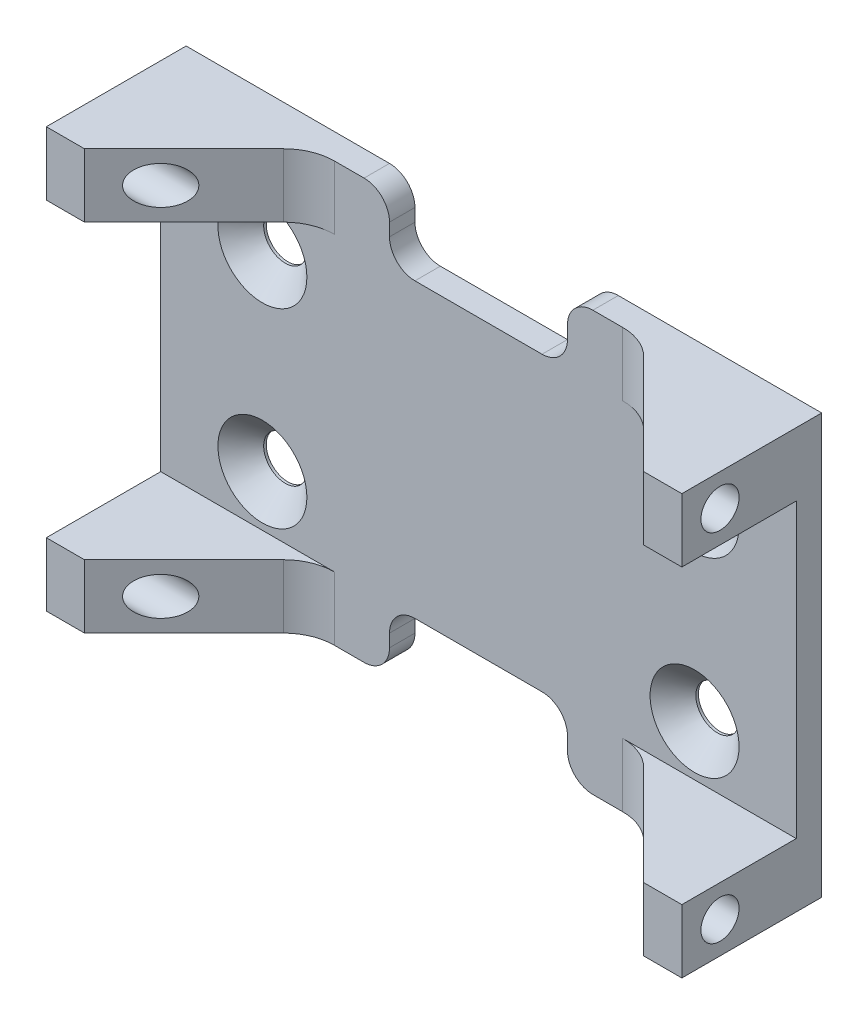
ISO-10303-21;
HEADER;
FILE_DESCRIPTION(('STEP AP214'),'2;1');
FILE_NAME('part.step','',(''),(''),'','','');
FILE_SCHEMA(('AUTOMOTIVE_DESIGN { 1 0 10303 214 1 1 1 1 }'));
ENDSEC;
DATA;
#1=APPLICATION_CONTEXT('core data for automotive mechanical design processes');
#2=APPLICATION_PROTOCOL_DEFINITION('international standard','automotive_design',2000,#1);
#3=PRODUCT_CONTEXT('',#1,'mechanical');
#4=PRODUCT('Part','Part','',(#3));
#5=PRODUCT_RELATED_PRODUCT_CATEGORY('part','',(#4));
#6=PRODUCT_DEFINITION_FORMATION('','',#4);
#7=PRODUCT_DEFINITION_CONTEXT('part definition',#1,'design');
#8=PRODUCT_DEFINITION('design','',#6,#7);
#9=PRODUCT_DEFINITION_SHAPE('','',#8);
#10=(LENGTH_UNIT() NAMED_UNIT(*) SI_UNIT(.MILLI.,.METRE.));
#11=(NAMED_UNIT(*) PLANE_ANGLE_UNIT() SI_UNIT($,.RADIAN.));
#12=(NAMED_UNIT(*) SI_UNIT($,.STERADIAN.) SOLID_ANGLE_UNIT());
#13=UNCERTAINTY_MEASURE_WITH_UNIT(LENGTH_MEASURE(1.E-05),#10,'distance_accuracy_value','');
#14=(GEOMETRIC_REPRESENTATION_CONTEXT(3) GLOBAL_UNCERTAINTY_ASSIGNED_CONTEXT((#13)) GLOBAL_UNIT_ASSIGNED_CONTEXT((#10,
#11,#12)) REPRESENTATION_CONTEXT('',''));
#15=CARTESIAN_POINT('',(0.,0.,0.));
#16=DIRECTION('',(0.,0.,1.));
#17=DIRECTION('',(1.,0.,0.));
#18=AXIS2_PLACEMENT_3D('',#15,#16,#17);
#19=CARTESIAN_POINT('',(0.,0.,2.));
#20=DIRECTION('',(0.,0.,1.));
#21=DIRECTION('',(1.,0.,0.));
#22=AXIS2_PLACEMENT_3D('',#19,#20,#21);
#23=PLANE('',#22);
#24=CARTESIAN_POINT('',(16.9999999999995,-7.5,2.));
#25=DIRECTION('',(0.,0.,1.));
#26=DIRECTION('',(1.,0.,0.));
#27=AXIS2_PLACEMENT_3D('',#24,#25,#26);
#28=CIRCLE('',#27,3.50000000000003);
#29=CARTESIAN_POINT('',(20.4999999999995,-7.5,2.));
#30=VERTEX_POINT('',#29);
#31=EDGE_CURVE('E471',#30,#30,#28,.F.);
#32=ORIENTED_EDGE('',*,*,#31,.T.);
#33=EDGE_LOOP('',(#32));
#34=FACE_BOUND('',#33,.T.);
#35=CARTESIAN_POINT('',(16.9999999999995,7.5,2.));
#36=DIRECTION('',(0.,0.,1.));
#37=DIRECTION('',(1.,0.,0.));
#38=AXIS2_PLACEMENT_3D('',#35,#36,#37);
#39=CIRCLE('',#38,3.50000000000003);
#40=CARTESIAN_POINT('',(20.4999999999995,7.5,2.));
#41=VERTEX_POINT('',#40);
#42=EDGE_CURVE('E468',#41,#41,#39,.F.);
#43=ORIENTED_EDGE('',*,*,#42,.T.);
#44=EDGE_LOOP('',(#43));
#45=FACE_BOUND('',#44,.T.);
#46=CARTESIAN_POINT('',(-16.9999999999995,-7.5,2.));
#47=DIRECTION('',(0.,0.,1.));
#48=DIRECTION('',(1.,0.,0.));
#49=AXIS2_PLACEMENT_3D('',#46,#47,#48);
#50=CIRCLE('',#49,3.5);
#51=CARTESIAN_POINT('',(-13.4999999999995,-7.5,2.));
#52=VERTEX_POINT('',#51);
#53=EDGE_CURVE('E462',#52,#52,#50,.F.);
#54=ORIENTED_EDGE('',*,*,#53,.T.);
#55=EDGE_LOOP('',(#54));
#56=FACE_BOUND('',#55,.T.);
#57=CARTESIAN_POINT('',(-16.9999999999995,7.5,2.));
#58=DIRECTION('',(0.,0.,1.));
#59=DIRECTION('',(1.,0.,0.));
#60=AXIS2_PLACEMENT_3D('',#57,#58,#59);
#61=CIRCLE('',#60,3.5);
#62=CARTESIAN_POINT('',(-13.4999999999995,7.5,2.));
#63=VERTEX_POINT('',#62);
#64=EDGE_CURVE('E459',#63,#63,#61,.F.);
#65=ORIENTED_EDGE('',*,*,#64,.T.);
#66=EDGE_LOOP('',(#65));
#67=FACE_BOUND('',#66,.T.);
#68=DIRECTION('',(1.,0.,0.));
#69=VECTOR('',#68,1.);
#70=CARTESIAN_POINT('',(-24.9999999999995,-16.5,2.));
#71=LINE('',#70,#69);
#72=CARTESIAN_POINT('',(-11.3431457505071,-16.5,2.));
#73=VERTEX_POINT('',#72);
#74=CARTESIAN_POINT('',(-9.,-16.5,2.));
#75=VERTEX_POINT('',#74);
#76=EDGE_CURVE('E369',#73,#75,#71,.T.);
#77=ORIENTED_EDGE('',*,*,#76,.T.);
#78=CARTESIAN_POINT('',(-9.,-14.5,2.));
#79=DIRECTION('',(0.,0.,1.));
#80=DIRECTION('',(1.,0.,0.));
#81=AXIS2_PLACEMENT_3D('',#78,#79,#80);
#82=CIRCLE('',#81,2.);
#83=CARTESIAN_POINT('',(-7.,-14.5,2.));
#84=VERTEX_POINT('',#83);
#85=EDGE_CURVE('E506',#75,#84,#82,.T.);
#86=ORIENTED_EDGE('',*,*,#85,.T.);
#87=DIRECTION('',(0.,1.,0.));
#88=VECTOR('',#87,1.);
#89=CARTESIAN_POINT('',(-7.,-16.5,2.));
#90=LINE('',#89,#88);
#91=CARTESIAN_POINT('',(-7.,-13.5,2.));
#92=VERTEX_POINT('',#91);
#93=EDGE_CURVE('E620',#84,#92,#90,.T.);
#94=ORIENTED_EDGE('',*,*,#93,.T.);
#95=CARTESIAN_POINT('',(-5.,-13.5,2.));
#96=DIRECTION('',(0.,0.,1.));
#97=DIRECTION('',(1.,0.,0.));
#98=AXIS2_PLACEMENT_3D('',#95,#96,#97);
#99=CIRCLE('',#98,2.);
#100=CARTESIAN_POINT('',(-5.,-11.5,2.));
#101=VERTEX_POINT('',#100);
#102=EDGE_CURVE('E552',#92,#101,#99,.F.);
#103=ORIENTED_EDGE('',*,*,#102,.T.);
#104=DIRECTION('',(1.,0.,0.));
#105=VECTOR('',#104,1.);
#106=CARTESIAN_POINT('',(-7.,-11.5,2.));
#107=LINE('',#106,#105);
#108=CARTESIAN_POINT('',(5.,-11.5,2.));
#109=VERTEX_POINT('',#108);
#110=EDGE_CURVE('E576',#101,#109,#107,.T.);
#111=ORIENTED_EDGE('',*,*,#110,.T.);
#112=CARTESIAN_POINT('',(5.,-13.5,2.));
#113=DIRECTION('',(0.,0.,1.));
#114=DIRECTION('',(1.,0.,0.));
#115=AXIS2_PLACEMENT_3D('',#112,#113,#114);
#116=CIRCLE('',#115,2.);
#117=CARTESIAN_POINT('',(7.,-13.5,2.));
#118=VERTEX_POINT('',#117);
#119=EDGE_CURVE('E556',#109,#118,#116,.F.);
#120=ORIENTED_EDGE('',*,*,#119,.T.);
#121=DIRECTION('',(0.,-1.,0.));
#122=VECTOR('',#121,1.);
#123=CARTESIAN_POINT('',(7.,-16.5,2.));
#124=LINE('',#123,#122);
#125=CARTESIAN_POINT('',(7.,-14.5,2.));
#126=VERTEX_POINT('',#125);
#127=EDGE_CURVE('E616',#118,#126,#124,.T.);
#128=ORIENTED_EDGE('',*,*,#127,.T.);
#129=CARTESIAN_POINT('',(9.,-14.5,2.));
#130=DIRECTION('',(0.,0.,1.));
#131=DIRECTION('',(1.,0.,0.));
#132=AXIS2_PLACEMENT_3D('',#129,#130,#131);
#133=CIRCLE('',#132,2.);
#134=CARTESIAN_POINT('',(9.,-16.5,2.));
#135=VERTEX_POINT('',#134);
#136=EDGE_CURVE('E504',#126,#135,#133,.T.);
#137=ORIENTED_EDGE('',*,*,#136,.T.);
#138=CARTESIAN_POINT('',(11.3431457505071,-16.5,2.));
#139=VERTEX_POINT('',#138);
#140=EDGE_CURVE('E368',#135,#139,#71,.T.);
#141=ORIENTED_EDGE('',*,*,#140,.T.);
#142=DIRECTION('',(0.,1.,0.));
#143=VECTOR('',#142,1.);
#144=CARTESIAN_POINT('',(11.3431457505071,0.,2.));
#145=LINE('',#144,#143);
#146=CARTESIAN_POINT('',(11.3431457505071,-11.5,2.));
#147=VERTEX_POINT('',#146);
#148=EDGE_CURVE('E423',#139,#147,#145,.T.);
#149=ORIENTED_EDGE('',*,*,#148,.T.);
#150=DIRECTION('',(-1.,0.,0.));
#151=VECTOR('',#150,1.);
#152=CARTESIAN_POINT('',(24.9999999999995,-11.5,2.));
#153=LINE('',#152,#151);
#154=CARTESIAN_POINT('',(25.0000000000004,-11.5,2.));
#155=VERTEX_POINT('',#154);
#156=EDGE_CURVE('E307',#155,#147,#153,.T.);
#157=ORIENTED_EDGE('',*,*,#156,.F.);
#158=DIRECTION('',(0.,1.,0.));
#159=VECTOR('',#158,1.);
#160=CARTESIAN_POINT('',(25.0000000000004,16.5,2.));
#161=LINE('',#160,#159);
#162=CARTESIAN_POINT('',(25.0000000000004,11.5,2.));
#163=VERTEX_POINT('',#162);
#164=EDGE_CURVE('E359',#155,#163,#161,.T.);
#165=ORIENTED_EDGE('',*,*,#164,.T.);
#166=DIRECTION('',(1.,0.,0.));
#167=VECTOR('',#166,1.);
#168=CARTESIAN_POINT('',(24.9999999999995,11.5,2.));
#169=LINE('',#168,#167);
#170=CARTESIAN_POINT('',(11.3431457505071,11.5,2.));
#171=VERTEX_POINT('',#170);
#172=EDGE_CURVE('E291',#171,#163,#169,.T.);
#173=ORIENTED_EDGE('',*,*,#172,.F.);
#174=DIRECTION('',(0.,1.,0.));
#175=VECTOR('',#174,1.);
#176=CARTESIAN_POINT('',(11.3431457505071,0.,2.));
#177=LINE('',#176,#175);
#178=CARTESIAN_POINT('',(11.3431457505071,16.5,2.));
#179=VERTEX_POINT('',#178);
#180=EDGE_CURVE('E420',#171,#179,#177,.T.);
#181=ORIENTED_EDGE('',*,*,#180,.T.);
#182=DIRECTION('',(-1.,0.,0.));
#183=VECTOR('',#182,1.);
#184=CARTESIAN_POINT('',(-24.9999999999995,16.5,2.));
#185=LINE('',#184,#183);
#186=CARTESIAN_POINT('',(9.,16.5,2.));
#187=VERTEX_POINT('',#186);
#188=EDGE_CURVE('E363',#179,#187,#185,.T.);
#189=ORIENTED_EDGE('',*,*,#188,.T.);
#190=CARTESIAN_POINT('',(9.,14.5,2.));
#191=DIRECTION('',(0.,0.,1.));
#192=DIRECTION('',(1.,0.,0.));
#193=AXIS2_PLACEMENT_3D('',#190,#191,#192);
#194=CIRCLE('',#193,2.);
#195=CARTESIAN_POINT('',(7.,14.5,2.));
#196=VERTEX_POINT('',#195);
#197=EDGE_CURVE('E502',#187,#196,#194,.T.);
#198=ORIENTED_EDGE('',*,*,#197,.T.);
#199=DIRECTION('',(0.,1.,0.));
#200=VECTOR('',#199,1.);
#201=CARTESIAN_POINT('',(7.,16.5,2.));
#202=LINE('',#201,#200);
#203=CARTESIAN_POINT('',(7.,13.5,2.));
#204=VERTEX_POINT('',#203);
#205=EDGE_CURVE('E597',#204,#196,#202,.T.);
#206=ORIENTED_EDGE('',*,*,#205,.F.);
#207=CARTESIAN_POINT('',(5.,13.5,2.));
#208=DIRECTION('',(0.,0.,1.));
#209=DIRECTION('',(1.,0.,0.));
#210=AXIS2_PLACEMENT_3D('',#207,#208,#209);
#211=CIRCLE('',#210,2.);
#212=CARTESIAN_POINT('',(5.,11.5,2.));
#213=VERTEX_POINT('',#212);
#214=EDGE_CURVE('E559',#204,#213,#211,.F.);
#215=ORIENTED_EDGE('',*,*,#214,.T.);
#216=DIRECTION('',(1.,0.,0.));
#217=VECTOR('',#216,1.);
#218=CARTESIAN_POINT('',(-7.,11.5,2.));
#219=LINE('',#218,#217);
#220=CARTESIAN_POINT('',(-5.,11.5,2.));
#221=VERTEX_POINT('',#220);
#222=EDGE_CURVE('E568',#221,#213,#219,.T.);
#223=ORIENTED_EDGE('',*,*,#222,.F.);
#224=CARTESIAN_POINT('',(-5.,13.5,2.));
#225=DIRECTION('',(0.,0.,1.));
#226=DIRECTION('',(1.,0.,0.));
#227=AXIS2_PLACEMENT_3D('',#224,#225,#226);
#228=CIRCLE('',#227,2.);
#229=CARTESIAN_POINT('',(-7.,13.5,2.));
#230=VERTEX_POINT('',#229);
#231=EDGE_CURVE('E43',#221,#230,#228,.F.);
#232=ORIENTED_EDGE('',*,*,#231,.T.);
#233=DIRECTION('',(0.,-1.,0.));
#234=VECTOR('',#233,1.);
#235=CARTESIAN_POINT('',(-7.,16.5,2.));
#236=LINE('',#235,#234);
#237=CARTESIAN_POINT('',(-7.,14.5,2.));
#238=VERTEX_POINT('',#237);
#239=EDGE_CURVE('E566',#238,#230,#236,.T.);
#240=ORIENTED_EDGE('',*,*,#239,.F.);
#241=CARTESIAN_POINT('',(-9.,14.5,2.));
#242=DIRECTION('',(0.,0.,1.));
#243=DIRECTION('',(1.,0.,0.));
#244=AXIS2_PLACEMENT_3D('',#241,#242,#243);
#245=CIRCLE('',#244,2.);
#246=CARTESIAN_POINT('',(-9.,16.5,2.));
#247=VERTEX_POINT('',#246);
#248=EDGE_CURVE('E500',#238,#247,#245,.T.);
#249=ORIENTED_EDGE('',*,*,#248,.T.);
#250=CARTESIAN_POINT('',(-11.3431457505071,16.5,2.));
#251=VERTEX_POINT('',#250);
#252=EDGE_CURVE('E361',#247,#251,#185,.T.);
#253=ORIENTED_EDGE('',*,*,#252,.T.);
#254=DIRECTION('',(0.,-1.,0.));
#255=VECTOR('',#254,1.);
#256=CARTESIAN_POINT('',(-11.3431457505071,0.,2.));
#257=LINE('',#256,#255);
#258=CARTESIAN_POINT('',(-11.3431457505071,11.5,2.));
#259=VERTEX_POINT('',#258);
#260=EDGE_CURVE('E408',#251,#259,#257,.T.);
#261=ORIENTED_EDGE('',*,*,#260,.T.);
#262=DIRECTION('',(1.,0.,0.));
#263=VECTOR('',#262,1.);
#264=CARTESIAN_POINT('',(-24.9999999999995,11.5,2.));
#265=LINE('',#264,#263);
#266=CARTESIAN_POINT('',(-24.9999999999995,11.5,2.));
#267=VERTEX_POINT('',#266);
#268=EDGE_CURVE('E341',#267,#259,#265,.T.);
#269=ORIENTED_EDGE('',*,*,#268,.F.);
#270=DIRECTION('',(0.,-1.,0.));
#271=VECTOR('',#270,1.);
#272=CARTESIAN_POINT('',(-24.9999999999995,16.5,2.));
#273=LINE('',#272,#271);
#274=CARTESIAN_POINT('',(-24.9999999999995,-11.5,2.));
#275=VERTEX_POINT('',#274);
#276=EDGE_CURVE('E366',#267,#275,#273,.T.);
#277=ORIENTED_EDGE('',*,*,#276,.T.);
#278=DIRECTION('',(-1.,0.,0.));
#279=VECTOR('',#278,1.);
#280=CARTESIAN_POINT('',(-24.9999999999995,-11.5,2.));
#281=LINE('',#280,#279);
#282=CARTESIAN_POINT('',(-11.3431457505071,-11.5,2.));
#283=VERTEX_POINT('',#282);
#284=EDGE_CURVE('E324',#283,#275,#281,.T.);
#285=ORIENTED_EDGE('',*,*,#284,.F.);
#286=DIRECTION('',(0.,-1.,0.));
#287=VECTOR('',#286,1.);
#288=CARTESIAN_POINT('',(-11.3431457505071,0.,2.));
#289=LINE('',#288,#287);
#290=EDGE_CURVE('E426',#283,#73,#289,.T.);
#291=ORIENTED_EDGE('',*,*,#290,.T.);
#292=EDGE_LOOP('',(#77,#86,#94,#103,#111,#120,#128,#137,#141,#149,#157,#165,#173,#181,#189,#198,
#206,#215,#223,#232,#240,#249,#253,#261,#269,#277,#285,#291));
#293=FACE_BOUND('',#292,.T.);
#294=ADVANCED_FACE('F35',(#34,#45,#56,#67,#293),#23,.T.);
#295=CARTESIAN_POINT('',(-24.9999999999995,-16.5,2.));
#296=DIRECTION('',(0.,1.,0.));
#297=DIRECTION('',(0.,0.,1.));
#298=AXIS2_PLACEMENT_3D('',#295,#296,#297);
#299=PLANE('',#298);
#300=DIRECTION('',(1.,0.,0.));
#301=VECTOR('',#300,1.);
#302=CARTESIAN_POINT('',(-24.9999999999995,-16.5,0.));
#303=LINE('',#302,#301);
#304=CARTESIAN_POINT('',(-24.9999999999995,-16.5,0.));
#305=VERTEX_POINT('',#304);
#306=CARTESIAN_POINT('',(-9.,-16.5,0.));
#307=VERTEX_POINT('',#306);
#308=EDGE_CURVE('E362',#305,#307,#303,.T.);
#309=ORIENTED_EDGE('',*,*,#308,.T.);
#310=DIRECTION('',(0.,0.,1.));
#311=VECTOR('',#310,1.);
#312=CARTESIAN_POINT('',(-9.,-16.5,2.));
#313=LINE('',#312,#311);
#314=EDGE_CURVE('E497',#307,#75,#313,.T.);
#315=ORIENTED_EDGE('',*,*,#314,.T.);
#316=ORIENTED_EDGE('',*,*,#76,.F.);
#317=CARTESIAN_POINT('',(-11.3431457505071,-16.5,6.));
#318=DIRECTION('',(0.,1.,0.));
#319=DIRECTION('',(0.,0.,1.));
#320=AXIS2_PLACEMENT_3D('',#317,#318,#319);
#321=CIRCLE('',#320,4.);
#322=CARTESIAN_POINT('',(-14.1715728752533,-16.5,3.17157287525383));
#323=VERTEX_POINT('',#322);
#324=EDGE_CURVE('E437',#73,#323,#321,.T.);
#325=ORIENTED_EDGE('',*,*,#324,.T.);
#326=DIRECTION('',(-0.707106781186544,0.,0.707106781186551));
#327=VECTOR('',#326,1.);
#328=CARTESIAN_POINT('',(-18.9999999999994,-16.5,7.99999999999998));
#329=LINE('',#328,#327);
#330=CARTESIAN_POINT('',(-21.9999999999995,-16.5,11.));
#331=VERTEX_POINT('',#330);
#332=EDGE_CURVE('E401',#323,#331,#329,.T.);
#333=ORIENTED_EDGE('',*,*,#332,.T.);
#334=DIRECTION('',(1.,0.,0.));
#335=VECTOR('',#334,1.);
#336=CARTESIAN_POINT('',(-24.9999999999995,-16.5,11.));
#337=LINE('',#336,#335);
#338=CARTESIAN_POINT('',(-24.9999999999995,-16.5,11.));
#339=VERTEX_POINT('',#338);
#340=EDGE_CURVE('E325',#339,#331,#337,.T.);
#341=ORIENTED_EDGE('',*,*,#340,.F.);
#342=DIRECTION('',(0.,0.,-1.));
#343=VECTOR('',#342,1.);
#344=CARTESIAN_POINT('',(-24.9999999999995,-16.5,2.));
#345=LINE('',#344,#343);
#346=EDGE_CURVE('E385',#339,#305,#345,.T.);
#347=ORIENTED_EDGE('',*,*,#346,.T.);
#348=EDGE_LOOP('',(#309,#315,#316,#325,#333,#341,#347));
#349=FACE_BOUND('',#348,.T.);
#350=ADVANCED_FACE('F673',(#349),#299,.F.);
#351=ORIENTED_EDGE('',*,*,#140,.F.);
#352=DIRECTION('',(0.,0.,1.));
#353=VECTOR('',#352,1.);
#354=CARTESIAN_POINT('',(9.,-16.5,0.));
#355=LINE('',#354,#353);
#356=CARTESIAN_POINT('',(9.,-16.5,0.));
#357=VERTEX_POINT('',#356);
#358=EDGE_CURVE('E530',#135,#357,#355,.F.);
#359=ORIENTED_EDGE('',*,*,#358,.T.);
#360=CARTESIAN_POINT('',(25.0000000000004,-16.5,0.));
#361=VERTEX_POINT('',#360);
#362=EDGE_CURVE('E380',#357,#361,#303,.T.);
#363=ORIENTED_EDGE('',*,*,#362,.T.);
#364=DIRECTION('',(0.,0.,-1.));
#365=VECTOR('',#364,1.);
#366=CARTESIAN_POINT('',(25.0000000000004,-16.5,2.));
#367=LINE('',#366,#365);
#368=CARTESIAN_POINT('',(25.0000000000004,-16.5,11.));
#369=VERTEX_POINT('',#368);
#370=EDGE_CURVE('E372',#369,#361,#367,.T.);
#371=ORIENTED_EDGE('',*,*,#370,.F.);
#372=DIRECTION('',(1.,0.,0.));
#373=VECTOR('',#372,1.);
#374=CARTESIAN_POINT('',(25.0000000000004,-16.5,11.));
#375=LINE('',#374,#373);
#376=CARTESIAN_POINT('',(21.9999999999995,-16.5,11.));
#377=VERTEX_POINT('',#376);
#378=EDGE_CURVE('E317',#377,#369,#375,.T.);
#379=ORIENTED_EDGE('',*,*,#378,.F.);
#380=DIRECTION('',(-0.707106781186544,0.,-0.707106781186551));
#381=VECTOR('',#380,1.);
#382=CARTESIAN_POINT('',(-5.99999999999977,-16.5,-16.9999999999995));
#383=LINE('',#382,#381);
#384=CARTESIAN_POINT('',(14.1715728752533,-16.5,3.17157287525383));
#385=VERTEX_POINT('',#384);
#386=EDGE_CURVE('E393',#377,#385,#383,.T.);
#387=ORIENTED_EDGE('',*,*,#386,.T.);
#388=CARTESIAN_POINT('',(11.3431457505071,-16.5,6.));
#389=DIRECTION('',(0.,1.,0.));
#390=DIRECTION('',(0.,0.,1.));
#391=AXIS2_PLACEMENT_3D('',#388,#389,#390);
#392=CIRCLE('',#391,4.);
#393=EDGE_CURVE('E444',#385,#139,#392,.T.);
#394=ORIENTED_EDGE('',*,*,#393,.T.);
#395=EDGE_LOOP('',(#351,#359,#363,#371,#379,#387,#394));
#396=FACE_BOUND('',#395,.T.);
#397=ADVANCED_FACE('F679',(#396),#299,.F.);
#398=CARTESIAN_POINT('',(0.,0.,0.));
#399=DIRECTION('',(0.,0.,1.));
#400=DIRECTION('',(1.,0.,0.));
#401=AXIS2_PLACEMENT_3D('',#398,#399,#400);
#402=PLANE('',#401);
#403=CARTESIAN_POINT('',(-16.9999999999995,7.5,0.));
#404=DIRECTION('',(0.,0.,1.));
#405=DIRECTION('',(1.,0.,0.));
#406=AXIS2_PLACEMENT_3D('',#403,#404,#405);
#407=CIRCLE('',#406,1.7);
#408=CARTESIAN_POINT('',(-15.2999999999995,7.5,0.));
#409=VERTEX_POINT('',#408);
#410=EDGE_CURVE('E637',#409,#409,#407,.T.);
#411=ORIENTED_EDGE('',*,*,#410,.T.);
#412=EDGE_LOOP('',(#411));
#413=FACE_BOUND('',#412,.T.);
#414=CARTESIAN_POINT('',(-16.9999999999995,-7.5,0.));
#415=DIRECTION('',(0.,0.,1.));
#416=DIRECTION('',(1.,0.,0.));
#417=AXIS2_PLACEMENT_3D('',#414,#415,#416);
#418=CIRCLE('',#417,1.7);
#419=CARTESIAN_POINT('',(-15.2999999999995,-7.5,0.));
#420=VERTEX_POINT('',#419);
#421=EDGE_CURVE('E634',#420,#420,#418,.T.);
#422=ORIENTED_EDGE('',*,*,#421,.T.);
#423=EDGE_LOOP('',(#422));
#424=FACE_BOUND('',#423,.T.);
#425=CARTESIAN_POINT('',(16.9999999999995,7.5,0.));
#426=DIRECTION('',(0.,0.,-1.));
#427=DIRECTION('',(-1.,0.,0.));
#428=AXIS2_PLACEMENT_3D('',#425,#426,#427);
#429=CIRCLE('',#428,1.7);
#430=CARTESIAN_POINT('',(15.2999999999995,7.5,0.));
#431=VERTEX_POINT('',#430);
#432=EDGE_CURVE('E631',#431,#431,#429,.T.);
#433=ORIENTED_EDGE('',*,*,#432,.F.);
#434=EDGE_LOOP('',(#433));
#435=FACE_BOUND('',#434,.T.);
#436=CARTESIAN_POINT('',(16.9999999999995,-7.5,0.));
#437=DIRECTION('',(0.,0.,-1.));
#438=DIRECTION('',(-1.,0.,0.));
#439=AXIS2_PLACEMENT_3D('',#436,#437,#438);
#440=CIRCLE('',#439,1.7);
#441=CARTESIAN_POINT('',(15.2999999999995,-7.5,0.));
#442=VERTEX_POINT('',#441);
#443=EDGE_CURVE('E628',#442,#442,#440,.T.);
#444=ORIENTED_EDGE('',*,*,#443,.F.);
#445=EDGE_LOOP('',(#444));
#446=FACE_BOUND('',#445,.T.);
#447=DIRECTION('',(0.,1.,0.));
#448=VECTOR('',#447,1.);
#449=CARTESIAN_POINT('',(-7.,0.,0.));
#450=LINE('',#449,#448);
#451=CARTESIAN_POINT('',(-7.,-14.5,0.));
#452=VERTEX_POINT('',#451);
#453=CARTESIAN_POINT('',(-7.,-13.5,0.));
#454=VERTEX_POINT('',#453);
#455=EDGE_CURVE('E494',#452,#454,#450,.T.);
#456=ORIENTED_EDGE('',*,*,#455,.F.);
#457=CARTESIAN_POINT('',(-9.,-14.5,0.));
#458=DIRECTION('',(0.,0.,1.));
#459=DIRECTION('',(1.,0.,0.));
#460=AXIS2_PLACEMENT_3D('',#457,#458,#459);
#461=CIRCLE('',#460,2.);
#462=EDGE_CURVE('E519',#452,#307,#461,.F.);
#463=ORIENTED_EDGE('',*,*,#462,.T.);
#464=ORIENTED_EDGE('',*,*,#308,.F.);
#465=DIRECTION('',(0.,-1.,0.));
#466=VECTOR('',#465,1.);
#467=CARTESIAN_POINT('',(-24.9999999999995,16.5,0.));
#468=LINE('',#467,#466);
#469=CARTESIAN_POINT('',(-24.9999999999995,16.5,0.));
#470=VERTEX_POINT('',#469);
#471=EDGE_CURVE('E378',#470,#305,#468,.T.);
#472=ORIENTED_EDGE('',*,*,#471,.F.);
#473=DIRECTION('',(-1.,0.,0.));
#474=VECTOR('',#473,1.);
#475=CARTESIAN_POINT('',(-24.9999999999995,16.5,0.));
#476=LINE('',#475,#474);
#477=CARTESIAN_POINT('',(-9.,16.5,0.));
#478=VERTEX_POINT('',#477);
#479=EDGE_CURVE('E375',#478,#470,#476,.T.);
#480=ORIENTED_EDGE('',*,*,#479,.F.);
#481=CARTESIAN_POINT('',(-9.,14.5,0.));
#482=DIRECTION('',(0.,0.,1.));
#483=DIRECTION('',(1.,0.,0.));
#484=AXIS2_PLACEMENT_3D('',#481,#482,#483);
#485=CIRCLE('',#484,2.);
#486=CARTESIAN_POINT('',(-7.,14.5,0.));
#487=VERTEX_POINT('',#486);
#488=EDGE_CURVE('E513',#478,#487,#485,.F.);
#489=ORIENTED_EDGE('',*,*,#488,.T.);
#490=DIRECTION('',(0.,-1.,0.));
#491=VECTOR('',#490,1.);
#492=CARTESIAN_POINT('',(-7.,0.,0.));
#493=LINE('',#492,#491);
#494=CARTESIAN_POINT('',(-7.,13.5,0.));
#495=VERTEX_POINT('',#494);
#496=EDGE_CURVE('E486',#487,#495,#493,.T.);
#497=ORIENTED_EDGE('',*,*,#496,.T.);
#498=CARTESIAN_POINT('',(-5.,13.5,0.));
#499=DIRECTION('',(0.,0.,1.));
#500=DIRECTION('',(1.,0.,0.));
#501=AXIS2_PLACEMENT_3D('',#498,#499,#500);
#502=CIRCLE('',#501,2.);
#503=CARTESIAN_POINT('',(-5.,11.5,0.));
#504=VERTEX_POINT('',#503);
#505=EDGE_CURVE('E11',#495,#504,#502,.T.);
#506=ORIENTED_EDGE('',*,*,#505,.T.);
#507=DIRECTION('',(1.,0.,0.));
#508=VECTOR('',#507,1.);
#509=CARTESIAN_POINT('',(0.,11.5,0.));
#510=LINE('',#509,#508);
#511=CARTESIAN_POINT('',(5.,11.5,0.));
#512=VERTEX_POINT('',#511);
#513=EDGE_CURVE('E480',#504,#512,#510,.T.);
#514=ORIENTED_EDGE('',*,*,#513,.T.);
#515=CARTESIAN_POINT('',(5.,13.5,0.));
#516=DIRECTION('',(0.,0.,1.));
#517=DIRECTION('',(1.,0.,0.));
#518=AXIS2_PLACEMENT_3D('',#515,#516,#517);
#519=CIRCLE('',#518,2.);
#520=CARTESIAN_POINT('',(7.,13.5,0.));
#521=VERTEX_POINT('',#520);
#522=EDGE_CURVE('E561',#512,#521,#519,.T.);
#523=ORIENTED_EDGE('',*,*,#522,.T.);
#524=DIRECTION('',(0.,1.,0.));
#525=VECTOR('',#524,1.);
#526=CARTESIAN_POINT('',(7.00000000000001,0.,0.));
#527=LINE('',#526,#525);
#528=CARTESIAN_POINT('',(7.,14.5,0.));
#529=VERTEX_POINT('',#528);
#530=EDGE_CURVE('E483',#521,#529,#527,.T.);
#531=ORIENTED_EDGE('',*,*,#530,.T.);
#532=CARTESIAN_POINT('',(9.,14.5,0.));
#533=DIRECTION('',(0.,0.,1.));
#534=DIRECTION('',(1.,0.,0.));
#535=AXIS2_PLACEMENT_3D('',#532,#533,#534);
#536=CIRCLE('',#535,2.);
#537=CARTESIAN_POINT('',(9.,16.5,0.));
#538=VERTEX_POINT('',#537);
#539=EDGE_CURVE('E515',#529,#538,#536,.F.);
#540=ORIENTED_EDGE('',*,*,#539,.T.);
#541=CARTESIAN_POINT('',(25.0000000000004,16.5,0.));
#542=VERTEX_POINT('',#541);
#543=EDGE_CURVE('E376',#542,#538,#476,.T.);
#544=ORIENTED_EDGE('',*,*,#543,.F.);
#545=DIRECTION('',(0.,1.,0.));
#546=VECTOR('',#545,1.);
#547=CARTESIAN_POINT('',(25.0000000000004,16.5,0.));
#548=LINE('',#547,#546);
#549=EDGE_CURVE('E358',#361,#542,#548,.T.);
#550=ORIENTED_EDGE('',*,*,#549,.F.);
#551=ORIENTED_EDGE('',*,*,#362,.F.);
#552=CARTESIAN_POINT('',(9.,-14.5,0.));
#553=DIRECTION('',(0.,0.,1.));
#554=DIRECTION('',(1.,0.,0.));
#555=AXIS2_PLACEMENT_3D('',#552,#553,#554);
#556=CIRCLE('',#555,2.);
#557=CARTESIAN_POINT('',(7.,-14.5,0.));
#558=VERTEX_POINT('',#557);
#559=EDGE_CURVE('E517',#357,#558,#556,.F.);
#560=ORIENTED_EDGE('',*,*,#559,.T.);
#561=DIRECTION('',(0.,-1.,0.));
#562=VECTOR('',#561,1.);
#563=CARTESIAN_POINT('',(7.00000000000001,0.,0.));
#564=LINE('',#563,#562);
#565=CARTESIAN_POINT('',(7.,-13.5,0.));
#566=VERTEX_POINT('',#565);
#567=EDGE_CURVE('E489',#566,#558,#564,.T.);
#568=ORIENTED_EDGE('',*,*,#567,.F.);
#569=CARTESIAN_POINT('',(5.,-13.5,0.));
#570=DIRECTION('',(0.,0.,1.));
#571=DIRECTION('',(1.,0.,0.));
#572=AXIS2_PLACEMENT_3D('',#569,#570,#571);
#573=CIRCLE('',#572,2.);
#574=CARTESIAN_POINT('',(5.,-11.5,0.));
#575=VERTEX_POINT('',#574);
#576=EDGE_CURVE('E50',#566,#575,#573,.T.);
#577=ORIENTED_EDGE('',*,*,#576,.T.);
#578=DIRECTION('',(1.,0.,0.));
#579=VECTOR('',#578,1.);
#580=CARTESIAN_POINT('',(0.,-11.5,0.));
#581=LINE('',#580,#579);
#582=CARTESIAN_POINT('',(-5.,-11.5,0.));
#583=VERTEX_POINT('',#582);
#584=EDGE_CURVE('E492',#583,#575,#581,.T.);
#585=ORIENTED_EDGE('',*,*,#584,.F.);
#586=CARTESIAN_POINT('',(-5.,-13.5,0.));
#587=DIRECTION('',(0.,0.,1.));
#588=DIRECTION('',(1.,0.,0.));
#589=AXIS2_PLACEMENT_3D('',#586,#587,#588);
#590=CIRCLE('',#589,2.);
#591=EDGE_CURVE('E554',#583,#454,#590,.T.);
#592=ORIENTED_EDGE('',*,*,#591,.T.);
#593=EDGE_LOOP('',(#456,#463,#464,#472,#480,#489,#497,#506,#514,#523,#531,#540,#544,#550,#551,
#560,#568,#577,#585,#592));
#594=FACE_BOUND('',#593,.T.);
#595=ADVANCED_FACE('F582',(#413,#424,#435,#446,#594),#402,.F.);
#596=CARTESIAN_POINT('',(-24.9999999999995,16.5,2.));
#597=DIRECTION('',(0.,-1.,0.));
#598=DIRECTION('',(0.,0.,-1.));
#599=AXIS2_PLACEMENT_3D('',#596,#597,#598);
#600=PLANE('',#599);
#601=ORIENTED_EDGE('',*,*,#252,.F.);
#602=DIRECTION('',(0.,0.,1.));
#603=VECTOR('',#602,1.);
#604=CARTESIAN_POINT('',(-9.,16.5,2.));
#605=LINE('',#604,#603);
#606=EDGE_CURVE('E550',#247,#478,#605,.F.);
#607=ORIENTED_EDGE('',*,*,#606,.T.);
#608=ORIENTED_EDGE('',*,*,#479,.T.);
#609=DIRECTION('',(0.,0.,-1.));
#610=VECTOR('',#609,1.);
#611=CARTESIAN_POINT('',(-24.9999999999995,16.5,2.));
#612=LINE('',#611,#610);
#613=CARTESIAN_POINT('',(-24.9999999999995,16.5,11.));
#614=VERTEX_POINT('',#613);
#615=EDGE_CURVE('E388',#614,#470,#612,.T.);
#616=ORIENTED_EDGE('',*,*,#615,.F.);
#617=DIRECTION('',(-1.,0.,0.));
#618=VECTOR('',#617,1.);
#619=CARTESIAN_POINT('',(-24.9999999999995,16.5,11.));
#620=LINE('',#619,#618);
#621=CARTESIAN_POINT('',(-21.9999999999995,16.5,11.));
#622=VERTEX_POINT('',#621);
#623=EDGE_CURVE('E351',#622,#614,#620,.T.);
#624=ORIENTED_EDGE('',*,*,#623,.F.);
#625=DIRECTION('',(0.707106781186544,0.,-0.707106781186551));
#626=VECTOR('',#625,1.);
#627=CARTESIAN_POINT('',(-18.9999999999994,16.5,7.99999999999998));
#628=LINE('',#627,#626);
#629=CARTESIAN_POINT('',(-14.1715728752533,16.5,3.17157287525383));
#630=VERTEX_POINT('',#629);
#631=EDGE_CURVE('E403',#622,#630,#628,.T.);
#632=ORIENTED_EDGE('',*,*,#631,.T.);
#633=CARTESIAN_POINT('',(-11.3431457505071,16.5,6.));
#634=DIRECTION('',(0.,-1.,0.));
#635=DIRECTION('',(0.,0.,-1.));
#636=AXIS2_PLACEMENT_3D('',#633,#634,#635);
#637=CIRCLE('',#636,4.);
#638=EDGE_CURVE('E453',#630,#251,#637,.T.);
#639=ORIENTED_EDGE('',*,*,#638,.T.);
#640=EDGE_LOOP('',(#601,#607,#608,#616,#624,#632,#639));
#641=FACE_BOUND('',#640,.T.);
#642=ADVANCED_FACE('F688',(#641),#600,.F.);
#643=CARTESIAN_POINT('',(25.0000000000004,16.5,2.));
#644=DIRECTION('',(-1.,0.,0.));
#645=DIRECTION('',(0.,0.,1.));
#646=AXIS2_PLACEMENT_3D('',#643,#644,#645);
#647=PLANE('',#646);
#648=CARTESIAN_POINT('',(25.0000000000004,-14.,8.));
#649=DIRECTION('',(-1.,0.,0.));
#650=DIRECTION('',(0.,0.,-1.));
#651=AXIS2_PLACEMENT_3D('',#648,#649,#650);
#652=CIRCLE('',#651,1.5);
#653=CARTESIAN_POINT('',(25.0000000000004,-14.,6.5));
#654=VERTEX_POINT('',#653);
#655=EDGE_CURVE('E417',#654,#654,#652,.T.);
#656=ORIENTED_EDGE('',*,*,#655,.T.);
#657=EDGE_LOOP('',(#656));
#658=FACE_BOUND('',#657,.T.);
#659=CARTESIAN_POINT('',(25.0000000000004,14.,8.));
#660=DIRECTION('',(-1.,0.,0.));
#661=DIRECTION('',(0.,0.,1.));
#662=AXIS2_PLACEMENT_3D('',#659,#660,#661);
#663=CIRCLE('',#662,1.5);
#664=CARTESIAN_POINT('',(25.0000000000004,14.,9.5));
#665=VERTEX_POINT('',#664);
#666=EDGE_CURVE('E412',#665,#665,#663,.T.);
#667=ORIENTED_EDGE('',*,*,#666,.T.);
#668=EDGE_LOOP('',(#667));
#669=FACE_BOUND('',#668,.T.);
#670=ORIENTED_EDGE('',*,*,#549,.T.);
#671=DIRECTION('',(0.,0.,-1.));
#672=VECTOR('',#671,1.);
#673=CARTESIAN_POINT('',(25.0000000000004,16.5,2.));
#674=LINE('',#673,#672);
#675=CARTESIAN_POINT('',(25.0000000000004,16.5,11.));
#676=VERTEX_POINT('',#675);
#677=EDGE_CURVE('E391',#676,#542,#674,.T.);
#678=ORIENTED_EDGE('',*,*,#677,.F.);
#679=DIRECTION('',(1.77635683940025E-13,1.,0.));
#680=VECTOR('',#679,1.);
#681=CARTESIAN_POINT('',(25.0000000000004,16.5,11.));
#682=LINE('',#681,#680);
#683=CARTESIAN_POINT('',(24.9999999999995,11.5,11.));
#684=VERTEX_POINT('',#683);
#685=EDGE_CURVE('E290',#684,#676,#682,.T.);
#686=ORIENTED_EDGE('',*,*,#685,.F.);
#687=DIRECTION('',(0.,0.,-1.));
#688=VECTOR('',#687,1.);
#689=CARTESIAN_POINT('',(24.9999999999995,11.5,11.));
#690=LINE('',#689,#688);
#691=EDGE_CURVE('E301',#684,#163,#690,.T.);
#692=ORIENTED_EDGE('',*,*,#691,.T.);
#693=ORIENTED_EDGE('',*,*,#164,.F.);
#694=DIRECTION('',(0.,0.,-1.));
#695=VECTOR('',#694,1.);
#696=CARTESIAN_POINT('',(24.9999999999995,-11.5,11.));
#697=LINE('',#696,#695);
#698=CARTESIAN_POINT('',(24.9999999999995,-11.5,11.));
#699=VERTEX_POINT('',#698);
#700=EDGE_CURVE('E320',#699,#155,#697,.T.);
#701=ORIENTED_EDGE('',*,*,#700,.F.);
#702=DIRECTION('',(-1.77635683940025E-13,1.,0.));
#703=VECTOR('',#702,1.);
#704=CARTESIAN_POINT('',(25.0000000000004,-16.5,11.));
#705=LINE('',#704,#703);
#706=EDGE_CURVE('E308',#369,#699,#705,.T.);
#707=ORIENTED_EDGE('',*,*,#706,.F.);
#708=ORIENTED_EDGE('',*,*,#370,.T.);
#709=EDGE_LOOP('',(#670,#678,#686,#692,#693,#701,#707,#708));
#710=FACE_BOUND('',#709,.T.);
#711=ADVANCED_FACE('F603',(#658,#669,#710),#647,.F.);
#712=ORIENTED_EDGE('',*,*,#543,.T.);
#713=DIRECTION('',(0.,0.,1.));
#714=VECTOR('',#713,1.);
#715=CARTESIAN_POINT('',(9.,16.5,2.));
#716=LINE('',#715,#714);
#717=EDGE_CURVE('E532',#538,#187,#716,.T.);
#718=ORIENTED_EDGE('',*,*,#717,.T.);
#719=ORIENTED_EDGE('',*,*,#188,.F.);
#720=CARTESIAN_POINT('',(11.3431457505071,16.5,6.));
#721=DIRECTION('',(0.,-1.,0.));
#722=DIRECTION('',(0.,0.,-1.));
#723=AXIS2_PLACEMENT_3D('',#720,#721,#722);
#724=CIRCLE('',#723,4.);
#725=CARTESIAN_POINT('',(14.1715728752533,16.5,3.17157287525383));
#726=VERTEX_POINT('',#725);
#727=EDGE_CURVE('E276',#179,#726,#724,.T.);
#728=ORIENTED_EDGE('',*,*,#727,.T.);
#729=DIRECTION('',(0.707106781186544,0.,0.707106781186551));
#730=VECTOR('',#729,1.);
#731=CARTESIAN_POINT('',(-5.99999999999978,16.5,-16.9999999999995));
#732=LINE('',#731,#730);
#733=CARTESIAN_POINT('',(21.9999999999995,16.5,11.));
#734=VERTEX_POINT('',#733);
#735=EDGE_CURVE('E269',#726,#734,#732,.T.);
#736=ORIENTED_EDGE('',*,*,#735,.T.);
#737=DIRECTION('',(-1.,0.,0.));
#738=VECTOR('',#737,1.);
#739=CARTESIAN_POINT('',(25.0000000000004,16.5,11.));
#740=LINE('',#739,#738);
#741=EDGE_CURVE('E274',#676,#734,#740,.T.);
#742=ORIENTED_EDGE('',*,*,#741,.F.);
#743=ORIENTED_EDGE('',*,*,#677,.T.);
#744=EDGE_LOOP('',(#712,#718,#719,#728,#736,#742,#743));
#745=FACE_BOUND('',#744,.T.);
#746=ADVANCED_FACE('F272',(#745),#600,.F.);
#747=CARTESIAN_POINT('',(-24.9999999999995,16.5,2.));
#748=DIRECTION('',(1.,0.,0.));
#749=DIRECTION('',(0.,0.,-1.));
#750=AXIS2_PLACEMENT_3D('',#747,#748,#749);
#751=PLANE('',#750);
#752=CARTESIAN_POINT('',(-24.9999999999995,-14.,8.));
#753=DIRECTION('',(-1.,0.,0.));
#754=DIRECTION('',(0.,0.,-1.));
#755=AXIS2_PLACEMENT_3D('',#752,#753,#754);
#756=CIRCLE('',#755,1.5);
#757=CARTESIAN_POINT('',(-24.9999999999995,-14.,6.5));
#758=VERTEX_POINT('',#757);
#759=EDGE_CURVE('E640',#758,#758,#756,.T.);
#760=ORIENTED_EDGE('',*,*,#759,.F.);
#761=EDGE_LOOP('',(#760));
#762=FACE_BOUND('',#761,.T.);
#763=CARTESIAN_POINT('',(-24.9999999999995,14.,8.));
#764=DIRECTION('',(-1.,0.,0.));
#765=DIRECTION('',(0.,0.,1.));
#766=AXIS2_PLACEMENT_3D('',#763,#764,#765);
#767=CIRCLE('',#766,1.5);
#768=CARTESIAN_POINT('',(-24.9999999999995,14.,9.5));
#769=VERTEX_POINT('',#768);
#770=EDGE_CURVE('E647',#769,#769,#767,.T.);
#771=ORIENTED_EDGE('',*,*,#770,.F.);
#772=EDGE_LOOP('',(#771));
#773=FACE_BOUND('',#772,.T.);
#774=ORIENTED_EDGE('',*,*,#471,.T.);
#775=ORIENTED_EDGE('',*,*,#346,.F.);
#776=DIRECTION('',(0.,-1.,0.));
#777=VECTOR('',#776,1.);
#778=CARTESIAN_POINT('',(-24.9999999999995,-16.5,11.));
#779=LINE('',#778,#777);
#780=CARTESIAN_POINT('',(-24.9999999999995,-11.5,11.));
#781=VERTEX_POINT('',#780);
#782=EDGE_CURVE('E333',#781,#339,#779,.T.);
#783=ORIENTED_EDGE('',*,*,#782,.F.);
#784=DIRECTION('',(0.,0.,-1.));
#785=VECTOR('',#784,1.);
#786=CARTESIAN_POINT('',(-24.9999999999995,-11.5,11.));
#787=LINE('',#786,#785);
#788=EDGE_CURVE('E336',#781,#275,#787,.T.);
#789=ORIENTED_EDGE('',*,*,#788,.T.);
#790=ORIENTED_EDGE('',*,*,#276,.F.);
#791=DIRECTION('',(0.,0.,-1.));
#792=VECTOR('',#791,1.);
#793=CARTESIAN_POINT('',(-24.9999999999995,11.5,11.));
#794=LINE('',#793,#792);
#795=CARTESIAN_POINT('',(-24.9999999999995,11.5,11.));
#796=VERTEX_POINT('',#795);
#797=EDGE_CURVE('E354',#796,#267,#794,.T.);
#798=ORIENTED_EDGE('',*,*,#797,.F.);
#799=DIRECTION('',(0.,-1.,0.));
#800=VECTOR('',#799,1.);
#801=CARTESIAN_POINT('',(-24.9999999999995,16.5,11.));
#802=LINE('',#801,#800);
#803=EDGE_CURVE('E342',#614,#796,#802,.T.);
#804=ORIENTED_EDGE('',*,*,#803,.F.);
#805=ORIENTED_EDGE('',*,*,#615,.T.);
#806=EDGE_LOOP('',(#774,#775,#783,#789,#790,#798,#804,#805));
#807=FACE_BOUND('',#806,.T.);
#808=ADVANCED_FACE('F691',(#762,#773,#807),#751,.F.);
#809=CARTESIAN_POINT('',(-24.9999999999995,11.5,11.));
#810=DIRECTION('',(0.,1.,0.));
#811=DIRECTION('',(0.,0.,1.));
#812=AXIS2_PLACEMENT_3D('',#809,#810,#811);
#813=PLANE('',#812);
#814=ORIENTED_EDGE('',*,*,#268,.T.);
#815=CARTESIAN_POINT('',(-11.3431457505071,11.5,6.));
#816=DIRECTION('',(0.,1.,0.));
#817=DIRECTION('',(0.,0.,1.));
#818=AXIS2_PLACEMENT_3D('',#815,#816,#817);
#819=CIRCLE('',#818,4.);
#820=CARTESIAN_POINT('',(-14.1715728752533,11.5,3.17157287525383));
#821=VERTEX_POINT('',#820);
#822=EDGE_CURVE('E451',#259,#821,#819,.T.);
#823=ORIENTED_EDGE('',*,*,#822,.T.);
#824=DIRECTION('',(-0.707106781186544,0.,0.707106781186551));
#825=VECTOR('',#824,1.);
#826=CARTESIAN_POINT('',(-23.4999999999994,11.5,12.5));
#827=LINE('',#826,#825);
#828=CARTESIAN_POINT('',(-21.9999999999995,11.5,11.));
#829=VERTEX_POINT('',#828);
#830=EDGE_CURVE('E406',#821,#829,#827,.T.);
#831=ORIENTED_EDGE('',*,*,#830,.T.);
#832=DIRECTION('',(1.,0.,0.));
#833=VECTOR('',#832,1.);
#834=CARTESIAN_POINT('',(-24.9999999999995,11.5,11.));
#835=LINE('',#834,#833);
#836=EDGE_CURVE('E345',#796,#829,#835,.T.);
#837=ORIENTED_EDGE('',*,*,#836,.F.);
#838=ORIENTED_EDGE('',*,*,#797,.T.);
#839=EDGE_LOOP('',(#814,#823,#831,#837,#838));
#840=FACE_BOUND('',#839,.T.);
#841=ADVANCED_FACE('F685',(#840),#813,.F.);
#842=CARTESIAN_POINT('',(0.,0.,11.));
#843=DIRECTION('',(0.,0.,1.));
#844=DIRECTION('',(1.,0.,0.));
#845=AXIS2_PLACEMENT_3D('',#842,#843,#844);
#846=PLANE('',#845);
#847=ORIENTED_EDGE('',*,*,#803,.T.);
#848=ORIENTED_EDGE('',*,*,#836,.T.);
#849=DIRECTION('',(0.,1.,0.));
#850=VECTOR('',#849,1.);
#851=CARTESIAN_POINT('',(-21.9999999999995,16.5,11.));
#852=LINE('',#851,#850);
#853=EDGE_CURVE('E348',#829,#622,#852,.T.);
#854=ORIENTED_EDGE('',*,*,#853,.T.);
#855=ORIENTED_EDGE('',*,*,#623,.T.);
#856=EDGE_LOOP('',(#847,#848,#854,#855));
#857=FACE_BOUND('',#856,.T.);
#858=ADVANCED_FACE('F786',(#857),#846,.T.);
#859=CARTESIAN_POINT('',(-24.9999999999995,-11.5,11.));
#860=DIRECTION('',(0.,-1.,0.));
#861=DIRECTION('',(0.,0.,-1.));
#862=AXIS2_PLACEMENT_3D('',#859,#860,#861);
#863=PLANE('',#862);
#864=ORIENTED_EDGE('',*,*,#284,.T.);
#865=ORIENTED_EDGE('',*,*,#788,.F.);
#866=DIRECTION('',(-1.,0.,0.));
#867=VECTOR('',#866,1.);
#868=CARTESIAN_POINT('',(-24.9999999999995,-11.5,11.));
#869=LINE('',#868,#867);
#870=CARTESIAN_POINT('',(-21.9999999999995,-11.5,11.));
#871=VERTEX_POINT('',#870);
#872=EDGE_CURVE('E331',#871,#781,#869,.T.);
#873=ORIENTED_EDGE('',*,*,#872,.F.);
#874=DIRECTION('',(0.707106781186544,0.,-0.707106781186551));
#875=VECTOR('',#874,1.);
#876=CARTESIAN_POINT('',(-23.4999999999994,-11.5,12.5));
#877=LINE('',#876,#875);
#878=CARTESIAN_POINT('',(-14.1715728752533,-11.5,3.17157287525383));
#879=VERTEX_POINT('',#878);
#880=EDGE_CURVE('E280',#871,#879,#877,.T.);
#881=ORIENTED_EDGE('',*,*,#880,.T.);
#882=CARTESIAN_POINT('',(-11.3431457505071,-11.5,6.));
#883=DIRECTION('',(0.,-1.,0.));
#884=DIRECTION('',(0.,0.,-1.));
#885=AXIS2_PLACEMENT_3D('',#882,#883,#884);
#886=CIRCLE('',#885,4.);
#887=EDGE_CURVE('E439',#879,#283,#886,.T.);
#888=ORIENTED_EDGE('',*,*,#887,.T.);
#889=EDGE_LOOP('',(#864,#865,#873,#881,#888));
#890=FACE_BOUND('',#889,.T.);
#891=ADVANCED_FACE('F801',(#890),#863,.F.);
#892=CARTESIAN_POINT('',(0.,0.,11.));
#893=DIRECTION('',(0.,0.,1.));
#894=DIRECTION('',(1.,0.,0.));
#895=AXIS2_PLACEMENT_3D('',#892,#893,#894);
#896=PLANE('',#895);
#897=ORIENTED_EDGE('',*,*,#340,.T.);
#898=DIRECTION('',(0.,1.,0.));
#899=VECTOR('',#898,1.);
#900=CARTESIAN_POINT('',(-21.9999999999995,-16.5,11.));
#901=LINE('',#900,#899);
#902=EDGE_CURVE('E328',#331,#871,#901,.T.);
#903=ORIENTED_EDGE('',*,*,#902,.T.);
#904=ORIENTED_EDGE('',*,*,#872,.T.);
#905=ORIENTED_EDGE('',*,*,#782,.T.);
#906=EDGE_LOOP('',(#897,#903,#904,#905));
#907=FACE_BOUND('',#906,.T.);
#908=ADVANCED_FACE('F805',(#907),#896,.T.);
#909=CARTESIAN_POINT('',(24.9999999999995,-11.5,11.));
#910=DIRECTION('',(0.,-1.,0.));
#911=DIRECTION('',(1.,0.,0.));
#912=AXIS2_PLACEMENT_3D('',#909,#910,#911);
#913=PLANE('',#912);
#914=ORIENTED_EDGE('',*,*,#156,.T.);
#915=CARTESIAN_POINT('',(11.3431457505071,-11.5,6.));
#916=DIRECTION('',(0.,-1.,0.));
#917=DIRECTION('',(1.,0.,0.));
#918=AXIS2_PLACEMENT_3D('',#915,#916,#917);
#919=CIRCLE('',#918,4.);
#920=CARTESIAN_POINT('',(14.1715728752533,-11.5,3.17157287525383));
#921=VERTEX_POINT('',#920);
#922=EDGE_CURVE('E442',#147,#921,#919,.T.);
#923=ORIENTED_EDGE('',*,*,#922,.T.);
#924=DIRECTION('',(0.707106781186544,0.,0.707106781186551));
#925=VECTOR('',#924,1.);
#926=CARTESIAN_POINT('',(23.4999999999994,-11.5,12.5));
#927=LINE('',#926,#925);
#928=CARTESIAN_POINT('',(21.9999999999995,-11.5,11.));
#929=VERTEX_POINT('',#928);
#930=EDGE_CURVE('E396',#921,#929,#927,.T.);
#931=ORIENTED_EDGE('',*,*,#930,.T.);
#932=DIRECTION('',(-1.,0.,0.));
#933=VECTOR('',#932,1.);
#934=CARTESIAN_POINT('',(24.9999999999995,-11.5,11.));
#935=LINE('',#934,#933);
#936=EDGE_CURVE('E311',#699,#929,#935,.T.);
#937=ORIENTED_EDGE('',*,*,#936,.F.);
#938=ORIENTED_EDGE('',*,*,#700,.T.);
#939=EDGE_LOOP('',(#914,#923,#931,#937,#938));
#940=FACE_BOUND('',#939,.T.);
#941=ADVANCED_FACE('F811',(#940),#913,.F.);
#942=CARTESIAN_POINT('',(0.,0.,11.));
#943=DIRECTION('',(0.,0.,1.));
#944=DIRECTION('',(1.,0.,0.));
#945=AXIS2_PLACEMENT_3D('',#942,#943,#944);
#946=PLANE('',#945);
#947=ORIENTED_EDGE('',*,*,#706,.T.);
#948=ORIENTED_EDGE('',*,*,#936,.T.);
#949=DIRECTION('',(0.,-1.,0.));
#950=VECTOR('',#949,1.);
#951=CARTESIAN_POINT('',(21.9999999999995,-16.5,11.));
#952=LINE('',#951,#950);
#953=EDGE_CURVE('E314',#929,#377,#952,.T.);
#954=ORIENTED_EDGE('',*,*,#953,.T.);
#955=ORIENTED_EDGE('',*,*,#378,.T.);
#956=EDGE_LOOP('',(#947,#948,#954,#955));
#957=FACE_BOUND('',#956,.T.);
#958=ADVANCED_FACE('F815',(#957),#946,.T.);
#959=CARTESIAN_POINT('',(24.9999999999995,11.5,11.));
#960=DIRECTION('',(0.,1.,0.));
#961=DIRECTION('',(-1.,0.,0.));
#962=AXIS2_PLACEMENT_3D('',#959,#960,#961);
#963=PLANE('',#962);
#964=ORIENTED_EDGE('',*,*,#172,.T.);
#965=ORIENTED_EDGE('',*,*,#691,.F.);
#966=DIRECTION('',(1.,0.,0.));
#967=VECTOR('',#966,1.);
#968=CARTESIAN_POINT('',(24.9999999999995,11.5,11.));
#969=LINE('',#968,#967);
#970=CARTESIAN_POINT('',(21.9999999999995,11.5,11.));
#971=VERTEX_POINT('',#970);
#972=EDGE_CURVE('E295',#971,#684,#969,.T.);
#973=ORIENTED_EDGE('',*,*,#972,.F.);
#974=DIRECTION('',(-0.707106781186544,0.,-0.707106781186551));
#975=VECTOR('',#974,1.);
#976=CARTESIAN_POINT('',(23.4999999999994,11.5,12.5));
#977=LINE('',#976,#975);
#978=CARTESIAN_POINT('',(14.1715728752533,11.5,3.17157287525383));
#979=VERTEX_POINT('',#978);
#980=EDGE_CURVE('E281',#971,#979,#977,.T.);
#981=ORIENTED_EDGE('',*,*,#980,.T.);
#982=CARTESIAN_POINT('',(11.3431457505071,11.5,6.));
#983=DIRECTION('',(0.,1.,0.));
#984=DIRECTION('',(-1.,0.,0.));
#985=AXIS2_PLACEMENT_3D('',#982,#983,#984);
#986=CIRCLE('',#985,4.);
#987=EDGE_CURVE('E448',#979,#171,#986,.T.);
#988=ORIENTED_EDGE('',*,*,#987,.T.);
#989=EDGE_LOOP('',(#964,#965,#973,#981,#988));
#990=FACE_BOUND('',#989,.T.);
#991=ADVANCED_FACE('F819',(#990),#963,.F.);
#992=CARTESIAN_POINT('',(0.,0.,11.));
#993=DIRECTION('',(0.,0.,1.));
#994=DIRECTION('',(1.,0.,0.));
#995=AXIS2_PLACEMENT_3D('',#992,#993,#994);
#996=PLANE('',#995);
#997=ORIENTED_EDGE('',*,*,#741,.T.);
#998=DIRECTION('',(0.,-1.,0.));
#999=VECTOR('',#998,1.);
#1000=CARTESIAN_POINT('',(21.9999999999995,16.5,11.));
#1001=LINE('',#1000,#999);
#1002=EDGE_CURVE('E287',#734,#971,#1001,.T.);
#1003=ORIENTED_EDGE('',*,*,#1002,.T.);
#1004=ORIENTED_EDGE('',*,*,#972,.T.);
#1005=ORIENTED_EDGE('',*,*,#685,.T.);
#1006=EDGE_LOOP('',(#997,#1003,#1004,#1005));
#1007=FACE_BOUND('',#1006,.T.);
#1008=ADVANCED_FACE('F286',(#1007),#996,.T.);
#1009=CARTESIAN_POINT('',(21.9999999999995,-16.5,11.0000000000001));
#1010=DIRECTION('',(0.707106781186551,0.,-0.707106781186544));
#1011=DIRECTION('',(0.,-1.,0.));
#1012=AXIS2_PLACEMENT_3D('',#1009,#1010,#1011);
#1013=PLANE('',#1012);
#1014=CARTESIAN_POINT('',(18.9999999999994,-14.,8.));
#1015=DIRECTION('',(0.707106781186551,0.,-0.707106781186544));
#1016=DIRECTION('',(-0.707106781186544,0.,-0.707106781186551));
#1017=AXIS2_PLACEMENT_3D('',#1014,#1015,#1016);
#1018=ELLIPSE('',#1017,2.12132034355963,1.5);
#1019=CARTESIAN_POINT('',(17.4999999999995,-14.,6.5));
#1020=VERTEX_POINT('',#1019);
#1021=EDGE_CURVE('E416',#1020,#1020,#1018,.T.);
#1022=ORIENTED_EDGE('',*,*,#1021,.T.);
#1023=EDGE_LOOP('',(#1022));
#1024=FACE_BOUND('',#1023,.T.);
#1025=ORIENTED_EDGE('',*,*,#930,.F.);
#1026=DIRECTION('',(0.,1.,0.));
#1027=VECTOR('',#1026,1.);
#1028=CARTESIAN_POINT('',(14.1715728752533,-16.5,3.17157287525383));
#1029=LINE('',#1028,#1027);
#1030=EDGE_CURVE('E431',#921,#385,#1029,.F.);
#1031=ORIENTED_EDGE('',*,*,#1030,.T.);
#1032=ORIENTED_EDGE('',*,*,#386,.F.);
#1033=ORIENTED_EDGE('',*,*,#953,.F.);
#1034=EDGE_LOOP('',(#1025,#1031,#1032,#1033));
#1035=FACE_BOUND('',#1034,.T.);
#1036=ADVANCED_FACE('F700',(#1024,#1035),#1013,.F.);
#1037=CARTESIAN_POINT('',(21.9999999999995,16.5,11.0000000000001));
#1038=DIRECTION('',(0.707106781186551,0.,-0.707106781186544));
#1039=DIRECTION('',(0.,-1.,0.));
#1040=AXIS2_PLACEMENT_3D('',#1037,#1038,#1039);
#1041=PLANE('',#1040);
#1042=CARTESIAN_POINT('',(18.9999999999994,14.,8.));
#1043=DIRECTION('',(0.707106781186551,0.,-0.707106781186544));
#1044=DIRECTION('',(-0.707106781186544,0.,-0.707106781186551));
#1045=AXIS2_PLACEMENT_3D('',#1042,#1043,#1044);
#1046=ELLIPSE('',#1045,2.12132034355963,1.5);
#1047=CARTESIAN_POINT('',(17.4999999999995,14.,6.5));
#1048=VERTEX_POINT('',#1047);
#1049=EDGE_CURVE('E304',#1048,#1048,#1046,.T.);
#1050=ORIENTED_EDGE('',*,*,#1049,.T.);
#1051=EDGE_LOOP('',(#1050));
#1052=FACE_BOUND('',#1051,.T.);
#1053=ORIENTED_EDGE('',*,*,#735,.F.);
#1054=DIRECTION('',(0.,1.,0.));
#1055=VECTOR('',#1054,1.);
#1056=CARTESIAN_POINT('',(14.1715728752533,16.5,3.17157287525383));
#1057=LINE('',#1056,#1055);
#1058=EDGE_CURVE('E433',#726,#979,#1057,.F.);
#1059=ORIENTED_EDGE('',*,*,#1058,.T.);
#1060=ORIENTED_EDGE('',*,*,#980,.F.);
#1061=ORIENTED_EDGE('',*,*,#1002,.F.);
#1062=EDGE_LOOP('',(#1053,#1059,#1060,#1061));
#1063=FACE_BOUND('',#1062,.T.);
#1064=ADVANCED_FACE('F293',(#1052,#1063),#1041,.F.);
#1065=CARTESIAN_POINT('',(-21.9999999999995,-16.5,11.));
#1066=DIRECTION('',(-0.707106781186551,0.,-0.707106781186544));
#1067=DIRECTION('',(0.,1.,0.));
#1068=AXIS2_PLACEMENT_3D('',#1065,#1066,#1067);
#1069=PLANE('',#1068);
#1070=CARTESIAN_POINT('',(-18.9999999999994,-14.,8.));
#1071=DIRECTION('',(-0.707106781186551,0.,-0.707106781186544));
#1072=DIRECTION('',(-0.707106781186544,0.,0.707106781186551));
#1073=AXIS2_PLACEMENT_3D('',#1070,#1071,#1072);
#1074=ELLIPSE('',#1073,2.12132034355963,1.5);
#1075=CARTESIAN_POINT('',(-20.4999999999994,-14.,9.5));
#1076=VERTEX_POINT('',#1075);
#1077=EDGE_CURVE('E413',#1076,#1076,#1074,.T.);
#1078=ORIENTED_EDGE('',*,*,#1077,.T.);
#1079=EDGE_LOOP('',(#1078));
#1080=FACE_BOUND('',#1079,.T.);
#1081=ORIENTED_EDGE('',*,*,#332,.F.);
#1082=DIRECTION('',(0.,-1.,0.));
#1083=VECTOR('',#1082,1.);
#1084=CARTESIAN_POINT('',(-14.1715728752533,-16.5,3.17157287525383));
#1085=LINE('',#1084,#1083);
#1086=EDGE_CURVE('E429',#323,#879,#1085,.F.);
#1087=ORIENTED_EDGE('',*,*,#1086,.T.);
#1088=ORIENTED_EDGE('',*,*,#880,.F.);
#1089=ORIENTED_EDGE('',*,*,#902,.F.);
#1090=EDGE_LOOP('',(#1081,#1087,#1088,#1089));
#1091=FACE_BOUND('',#1090,.T.);
#1092=ADVANCED_FACE('F706',(#1080,#1091),#1069,.F.);
#1093=CARTESIAN_POINT('',(-21.9999999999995,16.5,11.0000000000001));
#1094=DIRECTION('',(-0.707106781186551,0.,-0.707106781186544));
#1095=DIRECTION('',(0.,1.,0.));
#1096=AXIS2_PLACEMENT_3D('',#1093,#1094,#1095);
#1097=PLANE('',#1096);
#1098=CARTESIAN_POINT('',(-18.9999999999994,14.,8.));
#1099=DIRECTION('',(-0.707106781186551,0.,-0.707106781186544));
#1100=DIRECTION('',(-0.707106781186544,0.,0.707106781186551));
#1101=AXIS2_PLACEMENT_3D('',#1098,#1099,#1100);
#1102=ELLIPSE('',#1101,2.12132034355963,1.5);
#1103=CARTESIAN_POINT('',(-20.4999999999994,14.,9.5));
#1104=VERTEX_POINT('',#1103);
#1105=EDGE_CURVE('E409',#1104,#1104,#1102,.T.);
#1106=ORIENTED_EDGE('',*,*,#1105,.T.);
#1107=EDGE_LOOP('',(#1106));
#1108=FACE_BOUND('',#1107,.T.);
#1109=ORIENTED_EDGE('',*,*,#830,.F.);
#1110=DIRECTION('',(0.,-1.,0.));
#1111=VECTOR('',#1110,1.);
#1112=CARTESIAN_POINT('',(-14.1715728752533,16.5,3.17157287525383));
#1113=LINE('',#1112,#1111);
#1114=EDGE_CURVE('E435',#821,#630,#1113,.F.);
#1115=ORIENTED_EDGE('',*,*,#1114,.T.);
#1116=ORIENTED_EDGE('',*,*,#631,.F.);
#1117=ORIENTED_EDGE('',*,*,#853,.F.);
#1118=EDGE_LOOP('',(#1109,#1115,#1116,#1117));
#1119=FACE_BOUND('',#1118,.T.);
#1120=ADVANCED_FACE('F668',(#1108,#1119),#1097,.F.);
#1121=CARTESIAN_POINT('',(25.0000000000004,14.,8.));
#1122=DIRECTION('',(-1.,0.,0.));
#1123=DIRECTION('',(0.,0.,1.));
#1124=AXIS2_PLACEMENT_3D('',#1121,#1122,#1123);
#1125=CYLINDRICAL_SURFACE('',#1124,1.5);
#1126=ORIENTED_EDGE('',*,*,#770,.T.);
#1127=EDGE_LOOP('',(#1126));
#1128=FACE_BOUND('',#1127,.T.);
#1129=ORIENTED_EDGE('',*,*,#1105,.F.);
#1130=EDGE_LOOP('',(#1129));
#1131=FACE_BOUND('',#1130,.T.);
#1132=ADVANCED_FACE('F658',(#1128,#1131),#1125,.F.);
#1133=ORIENTED_EDGE('',*,*,#666,.F.);
#1134=EDGE_LOOP('',(#1133));
#1135=FACE_BOUND('',#1134,.T.);
#1136=ORIENTED_EDGE('',*,*,#1049,.F.);
#1137=EDGE_LOOP('',(#1136));
#1138=FACE_BOUND('',#1137,.T.);
#1139=ADVANCED_FACE('F655',(#1135,#1138),#1125,.F.);
#1140=CARTESIAN_POINT('',(25.0000000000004,-14.,8.));
#1141=DIRECTION('',(-1.,0.,0.));
#1142=DIRECTION('',(0.,0.,1.));
#1143=AXIS2_PLACEMENT_3D('',#1140,#1141,#1142);
#1144=CYLINDRICAL_SURFACE('',#1143,1.5);
#1145=ORIENTED_EDGE('',*,*,#759,.T.);
#1146=EDGE_LOOP('',(#1145));
#1147=FACE_BOUND('',#1146,.T.);
#1148=ORIENTED_EDGE('',*,*,#1077,.F.);
#1149=EDGE_LOOP('',(#1148));
#1150=FACE_BOUND('',#1149,.T.);
#1151=ADVANCED_FACE('F657',(#1147,#1150),#1144,.F.);
#1152=ORIENTED_EDGE('',*,*,#655,.F.);
#1153=EDGE_LOOP('',(#1152));
#1154=FACE_BOUND('',#1153,.T.);
#1155=ORIENTED_EDGE('',*,*,#1021,.F.);
#1156=EDGE_LOOP('',(#1155));
#1157=FACE_BOUND('',#1156,.T.);
#1158=ADVANCED_FACE('F665',(#1154,#1157),#1144,.F.);
#1159=CARTESIAN_POINT('',(-11.3431457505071,0.,6.));
#1160=DIRECTION('',(0.,-1.,0.));
#1161=DIRECTION('',(1.,0.,0.));
#1162=AXIS2_PLACEMENT_3D('',#1159,#1160,#1161);
#1163=CYLINDRICAL_SURFACE('',#1162,4.);
#1164=ORIENTED_EDGE('',*,*,#887,.F.);
#1165=ORIENTED_EDGE('',*,*,#1086,.F.);
#1166=ORIENTED_EDGE('',*,*,#324,.F.);
#1167=ORIENTED_EDGE('',*,*,#290,.F.);
#1168=EDGE_LOOP('',(#1164,#1165,#1166,#1167));
#1169=FACE_BOUND('',#1168,.T.);
#1170=ADVANCED_FACE('F713',(#1169),#1163,.F.);
#1171=CARTESIAN_POINT('',(11.3431457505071,0.,6.));
#1172=DIRECTION('',(0.,1.,0.));
#1173=DIRECTION('',(-1.,0.,0.));
#1174=AXIS2_PLACEMENT_3D('',#1171,#1172,#1173);
#1175=CYLINDRICAL_SURFACE('',#1174,4.);
#1176=ORIENTED_EDGE('',*,*,#393,.F.);
#1177=ORIENTED_EDGE('',*,*,#1030,.F.);
#1178=ORIENTED_EDGE('',*,*,#922,.F.);
#1179=ORIENTED_EDGE('',*,*,#148,.F.);
#1180=EDGE_LOOP('',(#1176,#1177,#1178,#1179));
#1181=FACE_BOUND('',#1180,.T.);
#1182=ADVANCED_FACE('F716',(#1181),#1175,.F.);
#1183=CARTESIAN_POINT('',(11.3431457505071,0.,6.));
#1184=DIRECTION('',(0.,1.,0.));
#1185=DIRECTION('',(-1.,0.,0.));
#1186=AXIS2_PLACEMENT_3D('',#1183,#1184,#1185);
#1187=CYLINDRICAL_SURFACE('',#1186,4.);
#1188=ORIENTED_EDGE('',*,*,#987,.F.);
#1189=ORIENTED_EDGE('',*,*,#1058,.F.);
#1190=ORIENTED_EDGE('',*,*,#727,.F.);
#1191=ORIENTED_EDGE('',*,*,#180,.F.);
#1192=EDGE_LOOP('',(#1188,#1189,#1190,#1191));
#1193=FACE_BOUND('',#1192,.T.);
#1194=ADVANCED_FACE('F720',(#1193),#1187,.F.);
#1195=CARTESIAN_POINT('',(-11.3431457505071,0.,6.));
#1196=DIRECTION('',(0.,-1.,0.));
#1197=DIRECTION('',(1.,0.,0.));
#1198=AXIS2_PLACEMENT_3D('',#1195,#1196,#1197);
#1199=CYLINDRICAL_SURFACE('',#1198,4.);
#1200=ORIENTED_EDGE('',*,*,#638,.F.);
#1201=ORIENTED_EDGE('',*,*,#1114,.F.);
#1202=ORIENTED_EDGE('',*,*,#822,.F.);
#1203=ORIENTED_EDGE('',*,*,#260,.F.);
#1204=EDGE_LOOP('',(#1200,#1201,#1202,#1203));
#1205=FACE_BOUND('',#1204,.T.);
#1206=ADVANCED_FACE('F724',(#1205),#1199,.F.);
#1207=CARTESIAN_POINT('',(-16.9999999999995,7.5,0.));
#1208=DIRECTION('',(0.,0.,1.));
#1209=DIRECTION('',(1.,0.,0.));
#1210=AXIS2_PLACEMENT_3D('',#1207,#1208,#1209);
#1211=CYLINDRICAL_SURFACE('',#1210,1.7);
#1212=CARTESIAN_POINT('',(-16.9999999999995,7.5,0.200000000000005));
#1213=DIRECTION('',(0.,0.,1.));
#1214=DIRECTION('',(1.,0.,0.));
#1215=AXIS2_PLACEMENT_3D('',#1212,#1213,#1214);
#1216=CIRCLE('',#1215,1.7);
#1217=CARTESIAN_POINT('',(-15.2999999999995,7.5,0.200000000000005));
#1218=VERTEX_POINT('',#1217);
#1219=EDGE_CURVE('E465',#1218,#1218,#1216,.T.);
#1220=ORIENTED_EDGE('',*,*,#1219,.T.);
#1221=EDGE_LOOP('',(#1220));
#1222=FACE_BOUND('',#1221,.T.);
#1223=ORIENTED_EDGE('',*,*,#410,.F.);
#1224=EDGE_LOOP('',(#1223));
#1225=FACE_BOUND('',#1224,.T.);
#1226=ADVANCED_FACE('F728',(#1222,#1225),#1211,.F.);
#1227=CARTESIAN_POINT('',(-16.9999999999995,-7.5,0.));
#1228=DIRECTION('',(0.,0.,1.));
#1229=DIRECTION('',(1.,0.,0.));
#1230=AXIS2_PLACEMENT_3D('',#1227,#1228,#1229);
#1231=CYLINDRICAL_SURFACE('',#1230,1.7);
#1232=CARTESIAN_POINT('',(-16.9999999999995,-7.5,0.200000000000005));
#1233=DIRECTION('',(0.,0.,1.));
#1234=DIRECTION('',(1.,0.,0.));
#1235=AXIS2_PLACEMENT_3D('',#1232,#1233,#1234);
#1236=CIRCLE('',#1235,1.7);
#1237=CARTESIAN_POINT('',(-15.2999999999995,-7.5,0.200000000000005));
#1238=VERTEX_POINT('',#1237);
#1239=EDGE_CURVE('E456',#1238,#1238,#1236,.T.);
#1240=ORIENTED_EDGE('',*,*,#1239,.T.);
#1241=EDGE_LOOP('',(#1240));
#1242=FACE_BOUND('',#1241,.T.);
#1243=ORIENTED_EDGE('',*,*,#421,.F.);
#1244=EDGE_LOOP('',(#1243));
#1245=FACE_BOUND('',#1244,.T.);
#1246=ADVANCED_FACE('F734',(#1242,#1245),#1231,.F.);
#1247=CARTESIAN_POINT('',(-16.9999999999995,-7.5,0.200000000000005));
#1248=DIRECTION('',(0.,0.,1.));
#1249=DIRECTION('',(1.,0.,0.));
#1250=AXIS2_PLACEMENT_3D('',#1247,#1248,#1249);
#1251=CONICAL_SURFACE('',#1250,1.7,0.785398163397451);
#1252=ORIENTED_EDGE('',*,*,#53,.F.);
#1253=EDGE_LOOP('',(#1252));
#1254=FACE_BOUND('',#1253,.T.);
#1255=ORIENTED_EDGE('',*,*,#1239,.F.);
#1256=EDGE_LOOP('',(#1255));
#1257=FACE_BOUND('',#1256,.T.);
#1258=ADVANCED_FACE('F730',(#1254,#1257),#1251,.F.);
#1259=CARTESIAN_POINT('',(-16.9999999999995,7.5,0.200000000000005));
#1260=DIRECTION('',(0.,0.,1.));
#1261=DIRECTION('',(1.,0.,0.));
#1262=AXIS2_PLACEMENT_3D('',#1259,#1260,#1261);
#1263=CONICAL_SURFACE('',#1262,1.7,0.785398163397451);
#1264=ORIENTED_EDGE('',*,*,#64,.F.);
#1265=EDGE_LOOP('',(#1264));
#1266=FACE_BOUND('',#1265,.T.);
#1267=ORIENTED_EDGE('',*,*,#1219,.F.);
#1268=EDGE_LOOP('',(#1267));
#1269=FACE_BOUND('',#1268,.T.);
#1270=ADVANCED_FACE('F733',(#1266,#1269),#1263,.F.);
#1271=CARTESIAN_POINT('',(16.9999999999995,7.5,0.));
#1272=DIRECTION('',(0.,0.,1.));
#1273=DIRECTION('',(1.,0.,0.));
#1274=AXIS2_PLACEMENT_3D('',#1271,#1272,#1273);
#1275=CYLINDRICAL_SURFACE('',#1274,1.7);
#1276=CARTESIAN_POINT('',(16.9999999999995,7.5,0.199999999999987));
#1277=DIRECTION('',(0.,0.,1.));
#1278=DIRECTION('',(1.,0.,0.));
#1279=AXIS2_PLACEMENT_3D('',#1276,#1277,#1278);
#1280=CIRCLE('',#1279,1.7);
#1281=CARTESIAN_POINT('',(18.6999999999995,7.5,0.199999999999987));
#1282=VERTEX_POINT('',#1281);
#1283=EDGE_CURVE('E477',#1282,#1282,#1280,.T.);
#1284=ORIENTED_EDGE('',*,*,#1283,.T.);
#1285=EDGE_LOOP('',(#1284));
#1286=FACE_BOUND('',#1285,.T.);
#1287=ORIENTED_EDGE('',*,*,#432,.T.);
#1288=EDGE_LOOP('',(#1287));
#1289=FACE_BOUND('',#1288,.T.);
#1290=ADVANCED_FACE('F738',(#1286,#1289),#1275,.F.);
#1291=CARTESIAN_POINT('',(16.9999999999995,-7.5,0.));
#1292=DIRECTION('',(0.,0.,1.));
#1293=DIRECTION('',(1.,0.,0.));
#1294=AXIS2_PLACEMENT_3D('',#1291,#1292,#1293);
#1295=CYLINDRICAL_SURFACE('',#1294,1.7);
#1296=CARTESIAN_POINT('',(16.9999999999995,-7.5,0.199999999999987));
#1297=DIRECTION('',(0.,0.,1.));
#1298=DIRECTION('',(1.,0.,0.));
#1299=AXIS2_PLACEMENT_3D('',#1296,#1297,#1298);
#1300=CIRCLE('',#1299,1.7);
#1301=CARTESIAN_POINT('',(18.6999999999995,-7.5,0.199999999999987));
#1302=VERTEX_POINT('',#1301);
#1303=EDGE_CURVE('E474',#1302,#1302,#1300,.T.);
#1304=ORIENTED_EDGE('',*,*,#1303,.T.);
#1305=EDGE_LOOP('',(#1304));
#1306=FACE_BOUND('',#1305,.T.);
#1307=ORIENTED_EDGE('',*,*,#443,.T.);
#1308=EDGE_LOOP('',(#1307));
#1309=FACE_BOUND('',#1308,.T.);
#1310=ADVANCED_FACE('F744',(#1306,#1309),#1295,.F.);
#1311=CARTESIAN_POINT('',(16.9999999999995,-7.5,2.));
#1312=DIRECTION('',(0.,0.,1.));
#1313=DIRECTION('',(1.,0.,0.));
#1314=AXIS2_PLACEMENT_3D('',#1311,#1312,#1313);
#1315=CONICAL_SURFACE('',#1314,3.50000000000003,0.785398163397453);
#1316=ORIENTED_EDGE('',*,*,#1303,.F.);
#1317=EDGE_LOOP('',(#1316));
#1318=FACE_BOUND('',#1317,.T.);
#1319=ORIENTED_EDGE('',*,*,#31,.F.);
#1320=EDGE_LOOP('',(#1319));
#1321=FACE_BOUND('',#1320,.T.);
#1322=ADVANCED_FACE('F740',(#1318,#1321),#1315,.F.);
#1323=CARTESIAN_POINT('',(16.9999999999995,7.5,2.));
#1324=DIRECTION('',(0.,0.,1.));
#1325=DIRECTION('',(1.,0.,0.));
#1326=AXIS2_PLACEMENT_3D('',#1323,#1324,#1325);
#1327=CONICAL_SURFACE('',#1326,3.50000000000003,0.785398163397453);
#1328=ORIENTED_EDGE('',*,*,#1283,.F.);
#1329=EDGE_LOOP('',(#1328));
#1330=FACE_BOUND('',#1329,.T.);
#1331=ORIENTED_EDGE('',*,*,#42,.F.);
#1332=EDGE_LOOP('',(#1331));
#1333=FACE_BOUND('',#1332,.T.);
#1334=ADVANCED_FACE('F743',(#1330,#1333),#1327,.F.);
#1335=CARTESIAN_POINT('',(-7.,16.5,-8.));
#1336=DIRECTION('',(-1.,0.,0.));
#1337=DIRECTION('',(0.,0.,1.));
#1338=AXIS2_PLACEMENT_3D('',#1335,#1336,#1337);
#1339=PLANE('',#1338);
#1340=ORIENTED_EDGE('',*,*,#239,.T.);
#1341=DIRECTION('',(0.,0.,1.));
#1342=VECTOR('',#1341,1.);
#1343=CARTESIAN_POINT('',(-7.,13.5,0.));
#1344=LINE('',#1343,#1342);
#1345=EDGE_CURVE('E548',#230,#495,#1344,.F.);
#1346=ORIENTED_EDGE('',*,*,#1345,.T.);
#1347=ORIENTED_EDGE('',*,*,#496,.F.);
#1348=DIRECTION('',(0.,0.,1.));
#1349=VECTOR('',#1348,1.);
#1350=CARTESIAN_POINT('',(-7.,14.5,-8.));
#1351=LINE('',#1350,#1349);
#1352=EDGE_CURVE('E545',#487,#238,#1351,.T.);
#1353=ORIENTED_EDGE('',*,*,#1352,.T.);
#1354=EDGE_LOOP('',(#1340,#1346,#1347,#1353));
#1355=FACE_BOUND('',#1354,.T.);
#1356=ADVANCED_FACE('F573',(#1355),#1339,.F.);
#1357=CARTESIAN_POINT('',(7.,16.5,-8.));
#1358=DIRECTION('',(1.,0.,0.));
#1359=DIRECTION('',(0.,1.,0.));
#1360=AXIS2_PLACEMENT_3D('',#1357,#1358,#1359);
#1361=PLANE('',#1360);
#1362=ORIENTED_EDGE('',*,*,#205,.T.);
#1363=DIRECTION('',(0.,0.,1.));
#1364=VECTOR('',#1363,1.);
#1365=CARTESIAN_POINT('',(7.,14.5,-8.));
#1366=LINE('',#1365,#1364);
#1367=EDGE_CURVE('E538',#196,#529,#1366,.F.);
#1368=ORIENTED_EDGE('',*,*,#1367,.T.);
#1369=ORIENTED_EDGE('',*,*,#530,.F.);
#1370=DIRECTION('',(0.,0.,1.));
#1371=VECTOR('',#1370,1.);
#1372=CARTESIAN_POINT('',(7.,13.5,2.));
#1373=LINE('',#1372,#1371);
#1374=EDGE_CURVE('E535',#521,#204,#1373,.T.);
#1375=ORIENTED_EDGE('',*,*,#1374,.T.);
#1376=EDGE_LOOP('',(#1362,#1368,#1369,#1375));
#1377=FACE_BOUND('',#1376,.T.);
#1378=ADVANCED_FACE('F594',(#1377),#1361,.F.);
#1379=CARTESIAN_POINT('',(-7.,11.5,-8.));
#1380=DIRECTION('',(0.,-1.,0.));
#1381=DIRECTION('',(1.,0.,0.));
#1382=AXIS2_PLACEMENT_3D('',#1379,#1380,#1381);
#1383=PLANE('',#1382);
#1384=ORIENTED_EDGE('',*,*,#222,.T.);
#1385=DIRECTION('',(0.,0.,1.));
#1386=VECTOR('',#1385,1.);
#1387=CARTESIAN_POINT('',(5.,11.5,0.));
#1388=LINE('',#1387,#1386);
#1389=EDGE_CURVE('E543',#213,#512,#1388,.F.);
#1390=ORIENTED_EDGE('',*,*,#1389,.T.);
#1391=ORIENTED_EDGE('',*,*,#513,.F.);
#1392=DIRECTION('',(0.,0.,1.));
#1393=VECTOR('',#1392,1.);
#1394=CARTESIAN_POINT('',(-5.,11.5,2.));
#1395=LINE('',#1394,#1393);
#1396=EDGE_CURVE('E540',#504,#221,#1395,.T.);
#1397=ORIENTED_EDGE('',*,*,#1396,.T.);
#1398=EDGE_LOOP('',(#1384,#1390,#1391,#1397));
#1399=FACE_BOUND('',#1398,.T.);
#1400=ADVANCED_FACE('F585',(#1399),#1383,.F.);
#1401=CARTESIAN_POINT('',(-7.,-16.5,-8.));
#1402=DIRECTION('',(1.,0.,0.));
#1403=DIRECTION('',(0.,0.,-1.));
#1404=AXIS2_PLACEMENT_3D('',#1401,#1402,#1403);
#1405=PLANE('',#1404);
#1406=ORIENTED_EDGE('',*,*,#93,.F.);
#1407=DIRECTION('',(0.,0.,1.));
#1408=VECTOR('',#1407,1.);
#1409=CARTESIAN_POINT('',(-7.,-14.5,0.));
#1410=LINE('',#1409,#1408);
#1411=EDGE_CURVE('E511',#84,#452,#1410,.F.);
#1412=ORIENTED_EDGE('',*,*,#1411,.T.);
#1413=ORIENTED_EDGE('',*,*,#455,.T.);
#1414=DIRECTION('',(0.,0.,1.));
#1415=VECTOR('',#1414,1.);
#1416=CARTESIAN_POINT('',(-7.,-13.5,2.));
#1417=LINE('',#1416,#1415);
#1418=EDGE_CURVE('E508',#454,#92,#1417,.T.);
#1419=ORIENTED_EDGE('',*,*,#1418,.T.);
#1420=EDGE_LOOP('',(#1406,#1412,#1413,#1419));
#1421=FACE_BOUND('',#1420,.T.);
#1422=ADVANCED_FACE('F968',(#1421),#1405,.T.);
#1423=CARTESIAN_POINT('',(-7.,-11.5,-8.));
#1424=DIRECTION('',(0.,-1.,0.));
#1425=DIRECTION('',(1.,0.,0.));
#1426=AXIS2_PLACEMENT_3D('',#1423,#1424,#1425);
#1427=PLANE('',#1426);
#1428=ORIENTED_EDGE('',*,*,#110,.F.);
#1429=DIRECTION('',(0.,0.,1.));
#1430=VECTOR('',#1429,1.);
#1431=CARTESIAN_POINT('',(-5.,-11.5,0.));
#1432=LINE('',#1431,#1430);
#1433=EDGE_CURVE('E57',#101,#583,#1432,.F.);
#1434=ORIENTED_EDGE('',*,*,#1433,.T.);
#1435=ORIENTED_EDGE('',*,*,#584,.T.);
#1436=DIRECTION('',(0.,0.,1.));
#1437=VECTOR('',#1436,1.);
#1438=CARTESIAN_POINT('',(5.,-11.5,2.));
#1439=LINE('',#1438,#1437);
#1440=EDGE_CURVE('E521',#575,#109,#1439,.T.);
#1441=ORIENTED_EDGE('',*,*,#1440,.T.);
#1442=EDGE_LOOP('',(#1428,#1434,#1435,#1441));
#1443=FACE_BOUND('',#1442,.T.);
#1444=ADVANCED_FACE('F978',(#1443),#1427,.T.);
#1445=CARTESIAN_POINT('',(7.,-16.5,-8.));
#1446=DIRECTION('',(-1.,0.,0.));
#1447=DIRECTION('',(0.,-1.,0.));
#1448=AXIS2_PLACEMENT_3D('',#1445,#1446,#1447);
#1449=PLANE('',#1448);
#1450=ORIENTED_EDGE('',*,*,#567,.T.);
#1451=DIRECTION('',(0.,0.,1.));
#1452=VECTOR('',#1451,1.);
#1453=CARTESIAN_POINT('',(7.,-14.5,2.));
#1454=LINE('',#1453,#1452);
#1455=EDGE_CURVE('E527',#558,#126,#1454,.T.);
#1456=ORIENTED_EDGE('',*,*,#1455,.T.);
#1457=ORIENTED_EDGE('',*,*,#127,.F.);
#1458=DIRECTION('',(0.,0.,1.));
#1459=VECTOR('',#1458,1.);
#1460=CARTESIAN_POINT('',(7.,-13.5,0.));
#1461=LINE('',#1460,#1459);
#1462=EDGE_CURVE('E525',#118,#566,#1461,.F.);
#1463=ORIENTED_EDGE('',*,*,#1462,.T.);
#1464=EDGE_LOOP('',(#1450,#1456,#1457,#1463));
#1465=FACE_BOUND('',#1464,.T.);
#1466=ADVANCED_FACE('F615',(#1465),#1449,.T.);
#1467=CARTESIAN_POINT('',(-9.,-14.5,2.));
#1468=DIRECTION('',(0.,0.,-1.));
#1469=DIRECTION('',(-1.,0.,0.));
#1470=AXIS2_PLACEMENT_3D('',#1467,#1468,#1469);
#1471=CYLINDRICAL_SURFACE('',#1470,2.);
#1472=ORIENTED_EDGE('',*,*,#462,.F.);
#1473=ORIENTED_EDGE('',*,*,#1411,.F.);
#1474=ORIENTED_EDGE('',*,*,#85,.F.);
#1475=ORIENTED_EDGE('',*,*,#314,.F.);
#1476=EDGE_LOOP('',(#1472,#1473,#1474,#1475));
#1477=FACE_BOUND('',#1476,.T.);
#1478=ADVANCED_FACE('F749',(#1477),#1471,.T.);
#1479=CARTESIAN_POINT('',(-5.,-13.5,-8.));
#1480=DIRECTION('',(0.,0.,-1.));
#1481=DIRECTION('',(-1.,0.,0.));
#1482=AXIS2_PLACEMENT_3D('',#1479,#1480,#1481);
#1483=CYLINDRICAL_SURFACE('',#1482,2.);
#1484=ORIENTED_EDGE('',*,*,#591,.F.);
#1485=ORIENTED_EDGE('',*,*,#1433,.F.);
#1486=ORIENTED_EDGE('',*,*,#102,.F.);
#1487=ORIENTED_EDGE('',*,*,#1418,.F.);
#1488=EDGE_LOOP('',(#1484,#1485,#1486,#1487));
#1489=FACE_BOUND('',#1488,.T.);
#1490=ADVANCED_FACE('F752',(#1489),#1483,.F.);
#1491=CARTESIAN_POINT('',(9.,-14.5,-8.));
#1492=DIRECTION('',(0.,0.,-1.));
#1493=DIRECTION('',(-1.,0.,0.));
#1494=AXIS2_PLACEMENT_3D('',#1491,#1492,#1493);
#1495=CYLINDRICAL_SURFACE('',#1494,2.);
#1496=ORIENTED_EDGE('',*,*,#559,.F.);
#1497=ORIENTED_EDGE('',*,*,#358,.F.);
#1498=ORIENTED_EDGE('',*,*,#136,.F.);
#1499=ORIENTED_EDGE('',*,*,#1455,.F.);
#1500=EDGE_LOOP('',(#1496,#1497,#1498,#1499));
#1501=FACE_BOUND('',#1500,.T.);
#1502=ADVANCED_FACE('F611',(#1501),#1495,.T.);
#1503=CARTESIAN_POINT('',(5.,-13.5,-8.));
#1504=DIRECTION('',(0.,0.,-1.));
#1505=DIRECTION('',(-1.,0.,0.));
#1506=AXIS2_PLACEMENT_3D('',#1503,#1504,#1505);
#1507=CYLINDRICAL_SURFACE('',#1506,2.);
#1508=ORIENTED_EDGE('',*,*,#576,.F.);
#1509=ORIENTED_EDGE('',*,*,#1462,.F.);
#1510=ORIENTED_EDGE('',*,*,#119,.F.);
#1511=ORIENTED_EDGE('',*,*,#1440,.F.);
#1512=EDGE_LOOP('',(#1508,#1509,#1510,#1511));
#1513=FACE_BOUND('',#1512,.T.);
#1514=ADVANCED_FACE('F759',(#1513),#1507,.F.);
#1515=CARTESIAN_POINT('',(9.,14.5,2.));
#1516=DIRECTION('',(0.,0.,1.));
#1517=DIRECTION('',(1.,0.,0.));
#1518=AXIS2_PLACEMENT_3D('',#1515,#1516,#1517);
#1519=CYLINDRICAL_SURFACE('',#1518,2.);
#1520=ORIENTED_EDGE('',*,*,#539,.F.);
#1521=ORIENTED_EDGE('',*,*,#1367,.F.);
#1522=ORIENTED_EDGE('',*,*,#197,.F.);
#1523=ORIENTED_EDGE('',*,*,#717,.F.);
#1524=EDGE_LOOP('',(#1520,#1521,#1522,#1523));
#1525=FACE_BOUND('',#1524,.T.);
#1526=ADVANCED_FACE('F599',(#1525),#1519,.T.);
#1527=CARTESIAN_POINT('',(5.,13.5,-8.));
#1528=DIRECTION('',(0.,0.,-1.));
#1529=DIRECTION('',(-1.,0.,0.));
#1530=AXIS2_PLACEMENT_3D('',#1527,#1528,#1529);
#1531=CYLINDRICAL_SURFACE('',#1530,2.);
#1532=ORIENTED_EDGE('',*,*,#522,.F.);
#1533=ORIENTED_EDGE('',*,*,#1389,.F.);
#1534=ORIENTED_EDGE('',*,*,#214,.F.);
#1535=ORIENTED_EDGE('',*,*,#1374,.F.);
#1536=EDGE_LOOP('',(#1532,#1533,#1534,#1535));
#1537=FACE_BOUND('',#1536,.T.);
#1538=ADVANCED_FACE('F588',(#1537),#1531,.F.);
#1539=CARTESIAN_POINT('',(-5.,13.5,-8.));
#1540=DIRECTION('',(0.,0.,-1.));
#1541=DIRECTION('',(-1.,0.,0.));
#1542=AXIS2_PLACEMENT_3D('',#1539,#1540,#1541);
#1543=CYLINDRICAL_SURFACE('',#1542,2.);
#1544=ORIENTED_EDGE('',*,*,#505,.F.);
#1545=ORIENTED_EDGE('',*,*,#1345,.F.);
#1546=ORIENTED_EDGE('',*,*,#231,.F.);
#1547=ORIENTED_EDGE('',*,*,#1396,.F.);
#1548=EDGE_LOOP('',(#1544,#1545,#1546,#1547));
#1549=FACE_BOUND('',#1548,.T.);
#1550=ADVANCED_FACE('F579',(#1549),#1543,.F.);
#1551=CARTESIAN_POINT('',(-9.,14.5,-8.));
#1552=DIRECTION('',(0.,0.,1.));
#1553=DIRECTION('',(1.,0.,0.));
#1554=AXIS2_PLACEMENT_3D('',#1551,#1552,#1553);
#1555=CYLINDRICAL_SURFACE('',#1554,2.);
#1556=ORIENTED_EDGE('',*,*,#488,.F.);
#1557=ORIENTED_EDGE('',*,*,#606,.F.);
#1558=ORIENTED_EDGE('',*,*,#248,.F.);
#1559=ORIENTED_EDGE('',*,*,#1352,.F.);
#1560=EDGE_LOOP('',(#1556,#1557,#1558,#1559));
#1561=FACE_BOUND('',#1560,.T.);
#1562=ADVANCED_FACE('F37',(#1561),#1555,.T.);
#1563=CLOSED_SHELL('',(#294,#350,#397,#595,#642,#711,#746,#808,#841,#858,#891,#908,#941,#958,
#991,#1008,#1036,#1064,#1092,#1120,#1132,#1139,#1151,#1158,#1170,#1182,#1194,#1206,#1226,#1246,
#1258,#1270,#1290,#1310,#1322,#1334,#1356,#1378,#1400,#1422,#1444,#1466,#1478,#1490,#1502,#1514,
#1526,#1538,#1550,#1562));
#1564=MANIFOLD_SOLID_BREP('B2',#1563);
#1565=ADVANCED_BREP_SHAPE_REPRESENTATION('',(#18,#1564),#14);
#1566=SHAPE_DEFINITION_REPRESENTATION(#9,#1565);
ENDSEC;
END-ISO-10303-21;
